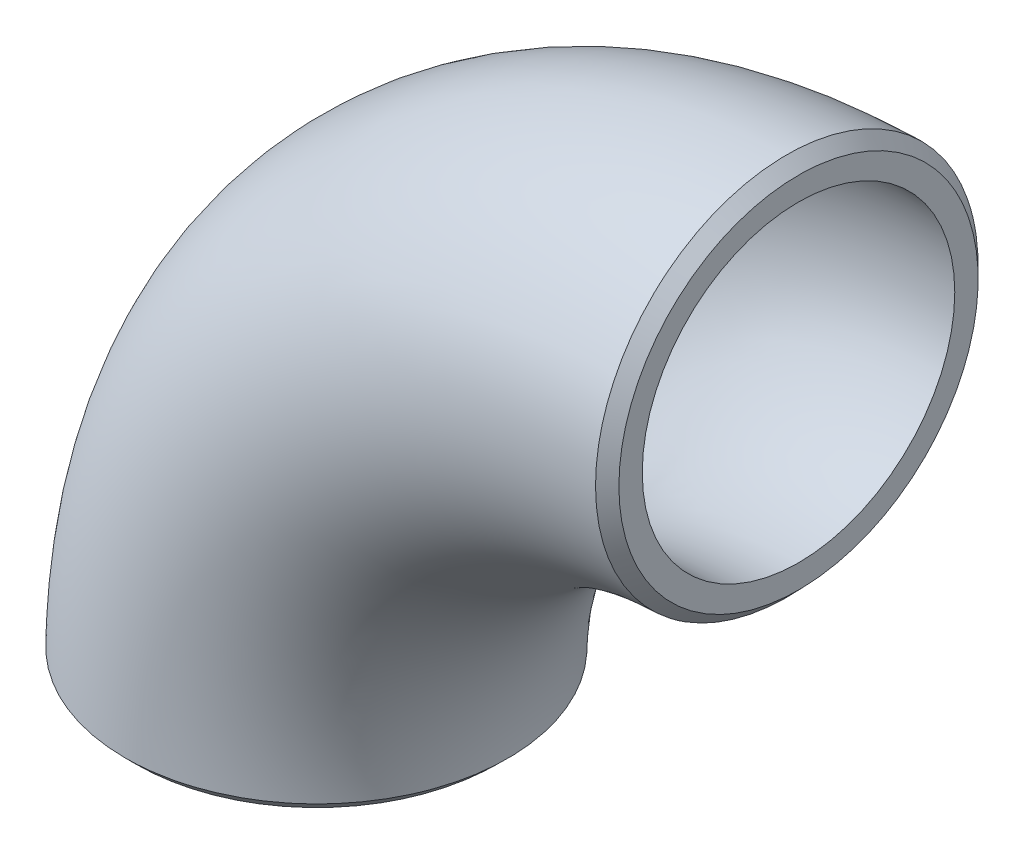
ISO-10303-21;
HEADER;
FILE_DESCRIPTION(('STEP AP214'),'2;1');
FILE_NAME('part.step','',(''),(''),'','','');
FILE_SCHEMA(('AUTOMOTIVE_DESIGN { 1 0 10303 214 1 1 1 1 }'));
ENDSEC;
DATA;
#1=APPLICATION_CONTEXT('core data for automotive mechanical design processes');
#2=APPLICATION_PROTOCOL_DEFINITION('international standard','automotive_design',2000,#1);
#3=PRODUCT_CONTEXT('',#1,'mechanical');
#4=PRODUCT('Part','Part','',(#3));
#5=PRODUCT_RELATED_PRODUCT_CATEGORY('part','',(#4));
#6=PRODUCT_DEFINITION_FORMATION('','',#4);
#7=PRODUCT_DEFINITION_CONTEXT('part definition',#1,'design');
#8=PRODUCT_DEFINITION('design','',#6,#7);
#9=PRODUCT_DEFINITION_SHAPE('','',#8);
#10=(LENGTH_UNIT() NAMED_UNIT(*) SI_UNIT(.MILLI.,.METRE.));
#11=(NAMED_UNIT(*) PLANE_ANGLE_UNIT() SI_UNIT($,.RADIAN.));
#12=(NAMED_UNIT(*) SI_UNIT($,.STERADIAN.) SOLID_ANGLE_UNIT());
#13=UNCERTAINTY_MEASURE_WITH_UNIT(LENGTH_MEASURE(1.E-05),#10,'distance_accuracy_value','');
#14=(GEOMETRIC_REPRESENTATION_CONTEXT(3) GLOBAL_UNCERTAINTY_ASSIGNED_CONTEXT((#13)) GLOBAL_UNIT_ASSIGNED_CONTEXT((#10,
#11,#12)) REPRESENTATION_CONTEXT('',''));
#15=CARTESIAN_POINT('',(0.,0.,0.));
#16=DIRECTION('',(0.,0.,1.));
#17=DIRECTION('',(1.,0.,0.));
#18=AXIS2_PLACEMENT_3D('',#15,#16,#17);
#19=CARTESIAN_POINT('',(0.,0.,0.));
#20=DIRECTION('',(0.,0.,1.));
#21=DIRECTION('',(1.,0.,0.));
#22=AXIS2_PLACEMENT_3D('',#19,#20,#21);
#23=TOROIDAL_SURFACE('',#22,76.2,30.226);
#24=CARTESIAN_POINT('',(-1.84576853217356,76.2014531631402,30.2259906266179));
#25=CARTESIAN_POINT('',(-1.84285933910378,74.2321868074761,30.2284703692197));
#26=CARTESIAN_POINT('',(-1.83967145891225,72.2236360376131,30.0321247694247));
#27=CARTESIAN_POINT('',(-1.83301571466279,68.3530641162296,29.2619378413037));
#28=CARTESIAN_POINT('',(-1.82952295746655,66.4699355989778,28.6939678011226));
#29=CARTESIAN_POINT('',(-1.82214636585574,62.7983053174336,27.1786467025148));
#30=CARTESIAN_POINT('',(-1.8182955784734,61.0310895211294,26.2342601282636));
#31=CARTESIAN_POINT('',(-1.81060855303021,57.7600465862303,24.0510303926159));
#32=CARTESIAN_POINT('',(-1.8067123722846,56.2273932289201,22.8002170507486));
#33=CARTESIAN_POINT('',(-1.79901407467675,53.4004230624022,19.9788931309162));
#34=CARTESIAN_POINT('',(-1.79533135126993,52.1484792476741,18.4510740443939));
#35=CARTESIAN_POINT('',(-1.78854206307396,49.9583101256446,15.18458884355));
#36=CARTESIAN_POINT('',(-1.78539503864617,49.0086837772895,13.4154177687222));
#37=CARTESIAN_POINT('',(-1.78017185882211,47.4887305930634,9.75144188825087));
#38=CARTESIAN_POINT('',(-1.7781015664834,46.9168019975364,7.86971083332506));
#39=CARTESIAN_POINT('',(-1.77524875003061,46.1392532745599,3.99557766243));
#40=CARTESIAN_POINT('',(-1.7744938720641,45.9401774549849,1.98869038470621));
#41=CARTESIAN_POINT('',(-1.77449060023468,45.9393197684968,-1.94737084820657));
#42=CARTESIAN_POINT('',(-1.77520427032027,46.1273858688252,-3.90772846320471));
#43=CARTESIAN_POINT('',(-1.77804533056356,46.9012215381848,-7.81968502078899));
#44=CARTESIAN_POINT('',(-1.78014003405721,47.4798002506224,-9.72315590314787));
#45=CARTESIAN_POINT('',(-1.78530474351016,48.9820775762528,-13.3579151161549));
#46=CARTESIAN_POINT('',(-1.788409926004,49.9171446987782,-15.1156753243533));
#47=CARTESIAN_POINT('',(-1.79527914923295,52.1302193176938,-18.4311189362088));
#48=CARTESIAN_POINT('',(-1.7989531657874,53.380554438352,-19.9519938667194));
#49=CARTESIAN_POINT('',(-1.806535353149,56.1599494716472,-22.7398002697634));
#50=CARTESIAN_POINT('',(-1.81050712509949,57.717857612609,-24.0211618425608));
#51=CARTESIAN_POINT('',(-1.81822811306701,61.0014346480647,-26.2161347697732));
#52=CARTESIAN_POINT('',(-1.82200946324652,62.7344584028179,-27.1460276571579));
#53=CARTESIAN_POINT('',(-1.829386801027,66.3980278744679,-28.6703345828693));
#54=CARTESIAN_POINT('',(-1.83295400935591,68.3181734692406,-29.2537259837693));
#55=CARTESIAN_POINT('',(-1.83958898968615,72.1747050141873,-30.0236336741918));
#56=CARTESIAN_POINT('',(-1.84272527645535,74.1457056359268,-30.2218464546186));
#57=CARTESIAN_POINT('',(-1.85157105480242,80.1209385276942,-30.2342269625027));
#58=CARTESIAN_POINT('',(-1.85658485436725,84.1075208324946,-29.4308875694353));
#59=CARTESIAN_POINT('',(-1.86275762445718,89.5566583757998,-27.1766672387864));
#60=CARTESIAN_POINT('',(-1.86463447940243,91.3201630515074,-26.2371853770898));
#61=CARTESIAN_POINT('',(-1.86799350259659,94.6291542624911,-24.0258500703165));
#62=CARTESIAN_POINT('',(-1.86945306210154,96.1489354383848,-22.7761402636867));
#63=CARTESIAN_POINT('',(-1.87203897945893,98.9386900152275,-19.9923858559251));
#64=CARTESIAN_POINT('',(-1.87317309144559,100.219949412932,-18.4324085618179));
#65=CARTESIAN_POINT('',(-1.87506065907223,102.409571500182,-15.1526473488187));
#66=CARTESIAN_POINT('',(-1.87583432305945,103.339452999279,-13.4190564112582));
#67=CARTESIAN_POINT('',(-1.87708254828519,104.864065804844,-9.74634460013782));
#68=CARTESIAN_POINT('',(-1.87754475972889,105.443644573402,-7.83188274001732));
#69=CARTESIAN_POINT('',(-1.87815354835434,106.210938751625,-3.97442760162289));
#70=CARTESIAN_POINT('',(-1.87830828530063,106.409004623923,-2.00318883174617));
#71=CARTESIAN_POINT('',(-1.878308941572,106.409841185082,1.99013995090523));
#72=CARTESIAN_POINT('',(-1.87815546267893,106.213396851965,3.95344833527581));
#73=CARTESIAN_POINT('',(-1.87754933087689,105.449360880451,7.81174393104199));
#74=CARTESIAN_POINT('',(-1.87708505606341,104.867198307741,9.73652488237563));
#75=CARTESIAN_POINT('',(-1.87584268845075,103.349602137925,13.3968411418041));
#76=CARTESIAN_POINT('',(-1.87507169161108,102.4225642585,15.1312533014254));
#77=CARTESIAN_POINT('',(-1.87318041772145,100.228251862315,18.421914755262));
#78=CARTESIAN_POINT('',(-1.87204890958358,98.9497841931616,19.9793838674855));
#79=CARTESIAN_POINT('',(-1.86946966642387,96.1664763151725,22.7605229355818));
#80=CARTESIAN_POINT('',(-1.86801016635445,94.6459281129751,24.0136261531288));
#81=CARTESIAN_POINT('',(-1.86464410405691,91.3292868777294,26.2320974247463));
#82=CARTESIAN_POINT('',(-1.8627795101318,89.5764348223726,27.1664706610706));
#83=CARTESIAN_POINT('',(-1.85866518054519,85.943514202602,28.6733597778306));
#84=CARTESIAN_POINT('',(-1.85638363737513,84.0361573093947,29.25508785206));
#85=CARTESIAN_POINT('',(-1.85136350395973,80.1295863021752,30.0325557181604));
#86=CARTESIAN_POINT('',(-1.84867772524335,78.1707195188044,30.2235108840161));
#87=CARTESIAN_POINT('',(-1.84576853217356,76.2014531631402,30.2259906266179));
#88=B_SPLINE_CURVE_WITH_KNOTS('',3,(#24,#25,#26,#27,#28,#29,#30,#31,#32,#33,#34,#35,#36,#37,#38,
#39,#40,#41,#42,#43,#44,#45,#46,#47,#48,#49,#50,#51,#52,#53,#54,#55,#56,#57,#58,#59,#60,#61,#62,
#63,#64,#65,#66,#67,#68,#69,#70,#71,#72,#73,#74,#75,#76,#77,#78,#79,#80,#81,#82,#83,#84,#85,#86,
#87),.UNSPECIFIED.,.T.,.F.,(4,2,2,2,2,2,2,2,2,2,2,2,2,2,2,2,2,2,2,2,2,2,2,2,2,2,2,2,2,2,2,4),
(-0.174454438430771,-0.168908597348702,-0.163362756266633,-0.157816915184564,-0.152271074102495,
-0.146725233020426,-0.141179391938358,-0.135633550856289,-0.13008770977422,-0.124541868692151,
-0.118996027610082,-0.113450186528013,-0.107904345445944,-0.102358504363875,-0.096812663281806,
-0.0912668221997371,-0.0857209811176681,-0.0746292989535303,-0.0690834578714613,
-0.0635376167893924,-0.0579917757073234,-0.0524459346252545,-0.0469000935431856,
-0.0413542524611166,-0.0358084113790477,-0.0302625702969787,-0.0247167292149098,
-0.0191708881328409,-0.0136250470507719,-0.00807920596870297,-0.00253336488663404,
0.0030124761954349),.UNSPECIFIED.);
#89=CARTESIAN_POINT('',(-1.84576853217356,76.2014531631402,30.2259906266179));
#90=VERTEX_POINT('',#89);
#91=EDGE_CURVE('E44',#90,#90,#88,.F.);
#92=ORIENTED_EDGE('',*,*,#91,.T.);
#93=EDGE_LOOP('',(#92));
#94=FACE_BOUND('',#93,.T.);
#95=CARTESIAN_POINT('',(-76.2014531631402,1.84576853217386,30.225990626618));
#96=CARTESIAN_POINT('',(-76.7119858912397,1.84652317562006,30.2257505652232));
#97=CARTESIAN_POINT('',(-77.2224815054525,1.84726323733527,30.2123069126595));
#98=CARTESIAN_POINT('',(-78.2447368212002,1.8487182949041,30.1594057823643));
#99=CARTESIAN_POINT('',(-78.756489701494,1.84943314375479,30.1198160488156));
#100=CARTESIAN_POINT('',(-79.7773714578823,1.85083419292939,30.0150282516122));
#101=CARTESIAN_POINT('',(-80.2865003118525,1.85152039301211,29.9498299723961));
#102=CARTESIAN_POINT('',(-81.2982038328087,1.85286001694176,29.7937310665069));
#103=CARTESIAN_POINT('',(-81.8007985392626,1.85351358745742,29.7029605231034));
#104=CARTESIAN_POINT('',(-82.7983877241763,1.85478901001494,29.496578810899));
#105=CARTESIAN_POINT('',(-83.2934068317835,1.85541099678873,29.381086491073));
#106=CARTESIAN_POINT('',(-84.2767915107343,1.8566266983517,29.1255109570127));
#107=CARTESIAN_POINT('',(-84.7651603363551,1.85722042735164,28.9854402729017));
#108=CARTESIAN_POINT('',(-85.7353757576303,1.85838130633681,28.680351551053));
#109=CARTESIAN_POINT('',(-86.2172031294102,1.85894838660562,28.5152723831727));
#110=CARTESIAN_POINT('',(-87.174480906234,1.86005790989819,28.1601797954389));
#111=CARTESIAN_POINT('',(-87.6498841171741,1.86060020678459,27.9700391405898));
#112=CARTESIAN_POINT('',(-88.5914044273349,1.86165831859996,27.56527029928));
#113=CARTESIAN_POINT('',(-89.0574985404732,1.86217407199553,27.3505886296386));
#114=CARTESIAN_POINT('',(-89.9776017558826,1.86317773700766,26.8981292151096));
#115=CARTESIAN_POINT('',(-90.4316253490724,1.86366568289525,26.6603809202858));
#116=CARTESIAN_POINT('',(-91.3255964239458,1.86461338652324,26.1630864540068));
#117=CARTESIAN_POINT('',(-91.7655858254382,1.86507323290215,25.9036156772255));
#118=CARTESIAN_POINT('',(-92.6296060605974,1.86596444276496,25.3638210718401));
#119=CARTESIAN_POINT('',(-93.0537041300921,1.86639593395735,25.0836048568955));
#120=CARTESIAN_POINT('',(-93.8874190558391,1.86723381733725,24.5022017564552));
#121=CARTESIAN_POINT('',(-94.2970324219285,1.86764020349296,24.2010098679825));
#122=CARTESIAN_POINT('',(-95.1018128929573,1.86842927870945,23.5774120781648));
#123=CARTESIAN_POINT('',(-95.4969314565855,1.86881189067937,23.254943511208));
#124=CARTESIAN_POINT('',(-96.2720979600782,1.86955412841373,22.5888621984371));
#125=CARTESIAN_POINT('',(-96.6520680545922,1.86991364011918,22.2451588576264));
#126=CARTESIAN_POINT('',(-97.3956410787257,1.87060978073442,21.5373905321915));
#127=CARTESIAN_POINT('',(-97.7591673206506,1.87094630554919,21.1732449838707));
#128=CARTESIAN_POINT('',(-98.465309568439,1.87159360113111,20.4288837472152));
#129=CARTESIAN_POINT('',(-98.8080264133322,1.87190449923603,20.0487637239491));
#130=CARTESIAN_POINT('',(-99.4720045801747,1.87250119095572,19.2734641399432));
#131=CARTESIAN_POINT('',(-99.7933632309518,1.87278710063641,18.8783679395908));
#132=CARTESIAN_POINT('',(-100.414898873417,1.87333529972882,18.0735239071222));
#133=CARTESIAN_POINT('',(-100.715129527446,1.87359764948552,17.6638174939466));
#134=CARTESIAN_POINT('',(-101.295048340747,1.87410054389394,16.8295117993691));
#135=CARTESIAN_POINT('',(-101.574716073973,1.8743410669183,16.4048983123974));
#136=CARTESIAN_POINT('',(-102.113565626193,1.87480114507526,15.5393426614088));
#137=CARTESIAN_POINT('',(-102.372615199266,1.87502056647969,15.0983181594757));
#138=CARTESIAN_POINT('',(-102.868992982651,1.87543823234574,14.202420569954));
#139=CARTESIAN_POINT('',(-103.106250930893,1.8756364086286,13.7475085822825));
#140=CARTESIAN_POINT('',(-103.557324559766,1.87601092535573,12.8263818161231));
#141=CARTESIAN_POINT('',(-103.771147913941,1.87618727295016,12.360170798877));
#142=CARTESIAN_POINT('',(-104.173777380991,1.87651766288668,11.4191699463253));
#143=CARTESIAN_POINT('',(-104.362675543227,1.87667178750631,10.9444194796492));
#144=CARTESIAN_POINT('',(-104.715629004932,1.8769585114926,9.98803795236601));
#145=CARTESIAN_POINT('',(-104.879785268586,1.87709119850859,9.50644414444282));
#146=CARTESIAN_POINT('',(-105.183244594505,1.87733549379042,8.53616539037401));
#147=CARTESIAN_POINT('',(-105.322579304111,1.87744712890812,8.04749034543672));
#148=CARTESIAN_POINT('',(-105.576771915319,1.87765011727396,7.06292447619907));
#149=CARTESIAN_POINT('',(-105.691587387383,1.87774143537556,6.56702270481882));
#150=CARTESIAN_POINT('',(-105.89652646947,1.87790412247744,5.56763011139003));
#151=CARTESIAN_POINT('',(-105.986527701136,1.87797539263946,5.06411415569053));
#152=CARTESIAN_POINT('',(-106.140915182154,1.87809744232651,4.05127968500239));
#153=CARTESIAN_POINT('',(-106.205205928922,1.87814814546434,3.54194663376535));
#154=CARTESIAN_POINT('',(-106.308099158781,1.87822916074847,2.5211443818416));
#155=CARTESIAN_POINT('',(-106.346724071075,1.87825949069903,2.00967744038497));
#156=CARTESIAN_POINT('',(-106.397600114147,1.87829938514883,0.988227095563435));
#157=CARTESIAN_POINT('',(-106.409994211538,1.87830906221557,0.478250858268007));
#158=CARTESIAN_POINT('',(-106.408822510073,1.87830814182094,-0.539259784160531));
#159=CARTESIAN_POINT('',(-106.39537878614,1.87829763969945,-1.04679436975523));
#160=CARTESIAN_POINT('',(-106.34318245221,1.87825670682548,-2.06101556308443));
#161=CARTESIAN_POINT('',(-106.304407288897,1.87822625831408,-2.56770101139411));
#162=CARTESIAN_POINT('',(-106.201022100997,1.87814484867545,-3.5803074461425));
#163=CARTESIAN_POINT('',(-106.136318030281,1.87809381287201,-4.08621884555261));
#164=CARTESIAN_POINT('',(-105.98090720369,1.87797094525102,-5.09733314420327));
#165=CARTESIAN_POINT('',(-105.890037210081,1.87789898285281,-5.60251093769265));
#166=CARTESIAN_POINT('',(-105.682650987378,1.87773433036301,-6.60785984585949));
#167=CARTESIAN_POINT('',(-105.566120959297,1.87764162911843,-7.10802811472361));
#168=CARTESIAN_POINT('',(-105.30821050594,1.87743561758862,-8.09984952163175));
#169=CARTESIAN_POINT('',(-105.166927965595,1.87732238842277,-8.59152811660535));
#170=CARTESIAN_POINT('',(-104.860174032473,1.87707537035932,-9.56535589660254));
#171=CARTESIAN_POINT('',(-104.694790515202,1.87694165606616,-10.0475327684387));
#172=CARTESIAN_POINT('',(-104.340444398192,1.87665367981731,-11.0014589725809));
#173=CARTESIAN_POINT('',(-104.151555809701,1.87649948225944,-11.4732357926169));
#174=CARTESIAN_POINT('',(-103.749727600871,1.87616961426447,-12.4076040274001));
#175=CARTESIAN_POINT('',(-103.536738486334,1.87599389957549,-12.8701741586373));
#176=CARTESIAN_POINT('',(-103.086868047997,1.87562026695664,-13.7856751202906));
#177=CARTESIAN_POINT('',(-102.849901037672,1.87542226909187,-14.238563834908));
#178=CARTESIAN_POINT('',(-102.352582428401,1.87500364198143,-15.1332007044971));
#179=CARTESIAN_POINT('',(-102.092158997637,1.87478294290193,-15.5749089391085));
#180=CARTESIAN_POINT('',(-101.548579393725,1.87431863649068,-16.4453064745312));
#181=CARTESIAN_POINT('',(-101.265379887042,1.87407498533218,-16.873968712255));
#182=CARTESIAN_POINT('',(-100.679126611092,1.87356627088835,-17.714135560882));
#183=CARTESIAN_POINT('',(-100.376185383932,1.87330132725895,-18.1257187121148));
#184=CARTESIAN_POINT('',(-99.7512092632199,1.87274958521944,-18.931057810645));
#185=CARTESIAN_POINT('',(-99.4292699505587,1.87246289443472,-19.3248879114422));
#186=CARTESIAN_POINT('',(-98.7664801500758,1.87186676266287,-20.095083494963));
#187=CARTESIAN_POINT('',(-98.4256638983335,1.87155736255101,-20.4714784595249));
#188=CARTESIAN_POINT('',(-97.7250850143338,1.87091478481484,-21.207576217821));
#189=CARTESIAN_POINT('',(-97.3652876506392,1.87058156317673,-21.567245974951));
#190=CARTESIAN_POINT('',(-96.625208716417,1.8698883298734,-22.2699427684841));
#191=CARTESIAN_POINT('',(-96.2448065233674,1.86952815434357,-22.6128427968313));
#192=CARTESIAN_POINT('',(-95.4661668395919,1.86878214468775,-23.2800299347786));
#193=CARTESIAN_POINT('',(-95.0678820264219,1.86839624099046,-23.6042617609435));
#194=CARTESIAN_POINT('',(-94.2562989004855,1.86759999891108,-24.2315286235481));
#195=CARTESIAN_POINT('',(-93.8430344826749,1.86718971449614,-24.5346074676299));
#196=CARTESIAN_POINT('',(-93.0038353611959,1.86634543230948,-25.1172818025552));
#197=CARTESIAN_POINT('',(-92.5779883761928,1.86591158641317,-25.3970036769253));
#198=CARTESIAN_POINT('',(-91.7140431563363,1.86501946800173,-25.9341439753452));
#199=CARTESIAN_POINT('',(-91.2759808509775,1.86456126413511,-26.1916202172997));
#200=CARTESIAN_POINT('',(-90.3871459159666,1.86361815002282,-26.6842092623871));
#201=CARTESIAN_POINT('',(-89.9363666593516,1.86313322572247,-26.9193101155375));
#202=CARTESIAN_POINT('',(-89.0219110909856,1.86213482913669,-27.3672574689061));
#203=CARTESIAN_POINT('',(-88.5581948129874,1.86162126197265,-27.5800223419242));
#204=CARTESIAN_POINT('',(-87.618360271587,1.86056436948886,-27.9828675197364));
#205=CARTESIAN_POINT('',(-87.1421930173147,1.86002091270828,-28.1728335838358));
#206=CARTESIAN_POINT('',(-86.1803751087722,1.85890529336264,-28.5282793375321));
#207=CARTESIAN_POINT('',(-85.6947171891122,1.85833310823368,-28.6937393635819));
#208=CARTESIAN_POINT('',(-84.7166275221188,1.8571616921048,-28.9996489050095));
#209=CARTESIAN_POINT('',(-84.2242107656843,1.85656251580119,-29.140146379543));
#210=CARTESIAN_POINT('',(-83.2351537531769,1.85533839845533,-29.395374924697));
#211=CARTESIAN_POINT('',(-82.7385433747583,1.85471358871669,-29.510221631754));
#212=CARTESIAN_POINT('',(-81.7417834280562,1.85343715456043,-29.7140186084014));
#213=CARTESIAN_POINT('',(-81.2416514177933,1.85278562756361,-29.8030548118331));
#214=CARTESIAN_POINT('',(-80.2363916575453,1.85145259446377,-29.9561339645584));
#215=CARTESIAN_POINT('',(-79.7312550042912,1.85077102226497,-30.0201184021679));
#216=CARTESIAN_POINT('',(-78.7167031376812,1.84937697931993,-30.1227319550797));
#217=CARTESIAN_POINT('',(-78.2072792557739,1.84866441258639,-30.1612752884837));
#218=CARTESIAN_POINT('',(-77.1849313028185,1.84720818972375,-30.213002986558));
#219=CARTESIAN_POINT('',(-76.6720016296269,1.84646441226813,-30.226076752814));
#220=CARTESIAN_POINT('',(-75.6449329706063,1.84494553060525,-30.2259116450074));
#221=CARTESIAN_POINT('',(-75.1307939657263,1.84417035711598,-30.2126110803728));
#222=CARTESIAN_POINT('',(-74.1041371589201,1.84259059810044,-30.1593174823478));
#223=CARTESIAN_POINT('',(-73.5916187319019,1.84178602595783,-30.1193364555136));
#224=CARTESIAN_POINT('',(-72.5696950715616,1.84014983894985,-30.0133534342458));
#225=CARTESIAN_POINT('',(-72.0602877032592,1.83931824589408,-29.9473719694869));
#226=CARTESIAN_POINT('',(-71.0460846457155,1.83762977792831,-29.7898098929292));
#227=CARTESIAN_POINT('',(-70.5412840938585,1.83677293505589,-29.6982605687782));
#228=CARTESIAN_POINT('',(-69.5377923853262,1.83503589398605,-29.4900503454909));
#229=CARTESIAN_POINT('',(-69.0390922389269,1.83415573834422,-29.3734327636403));
#230=CARTESIAN_POINT('',(-68.0493036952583,1.83237393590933,-29.1155477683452));
#231=CARTESIAN_POINT('',(-67.5582006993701,1.83147234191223,-28.9743363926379));
#232=CARTESIAN_POINT('',(-66.5851000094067,1.82964960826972,-28.6677550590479));
#233=CARTESIAN_POINT('',(-66.1030806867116,1.82872853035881,-28.502453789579));
#234=CARTESIAN_POINT('',(-65.149530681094,1.82686822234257,-28.1480323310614));
#235=CARTESIAN_POINT('',(-64.6779727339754,1.82592905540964,-27.958985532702));
#236=CARTESIAN_POINT('',(-63.7436668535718,1.8240290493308,-27.5565124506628));
#237=CARTESIAN_POINT('',(-63.280950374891,1.82306815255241,-27.3430131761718));
#238=CARTESIAN_POINT('',(-62.3649161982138,1.82112731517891,-26.892060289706));
#239=CARTESIAN_POINT('',(-61.9116464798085,1.82014731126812,-26.6545092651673));
#240=CARTESIAN_POINT('',(-61.0165630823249,1.8181732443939,-26.1562318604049));
#241=CARTESIAN_POINT('',(-60.5747803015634,1.81717915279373,-25.89544994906));
#242=CARTESIAN_POINT('',(-59.7050325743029,1.81518236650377,-25.3515403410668));
#243=CARTESIAN_POINT('',(-59.2770712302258,1.81417966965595,-25.0684068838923));
#244=CARTESIAN_POINT('',(-58.438248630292,1.81217523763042,-24.4823629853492));
#245=CARTESIAN_POINT('',(-58.0273095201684,1.81117352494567,-24.1795639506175));
#246=CARTESIAN_POINT('',(-57.2229315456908,1.80917502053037,-23.5547340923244));
#247=CARTESIAN_POINT('',(-56.8294296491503,1.80817822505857,-23.2327844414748));
#248=CARTESIAN_POINT('',(-56.0595798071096,1.80619167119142,-22.5697471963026));
#249=CARTESIAN_POINT('',(-55.6832153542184,1.80520190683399,-22.2286787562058));
#250=CARTESIAN_POINT('',(-54.9469437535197,1.8032305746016,-21.5273433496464));
#251=CARTESIAN_POINT('',(-54.5870818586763,1.80224903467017,-21.1670288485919));
#252=CARTESIAN_POINT('',(-53.8841463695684,1.80029721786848,-20.4260100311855));
#253=CARTESIAN_POINT('',(-53.5411940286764,1.79932705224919,-20.045190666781));
#254=CARTESIAN_POINT('',(-52.8741280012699,1.79740860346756,-19.2659489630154));
#255=CARTESIAN_POINT('',(-52.5500577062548,1.79646037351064,-18.8674895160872));
#256=CARTESIAN_POINT('',(-51.9233585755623,1.79459737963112,-18.0558738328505));
#257=CARTESIAN_POINT('',(-51.6206704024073,1.79368252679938,-17.642763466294));
#258=CARTESIAN_POINT('',(-51.0389346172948,1.79189663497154,-16.804114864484));
#259=CARTESIAN_POINT('',(-50.7597488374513,1.79102535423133,-16.3786724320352));
#260=CARTESIAN_POINT('',(-50.2233941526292,1.78932830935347,-15.5152579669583));
#261=CARTESIAN_POINT('',(-49.9661843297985,1.78850246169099,-15.0773113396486));
#262=CARTESIAN_POINT('',(-49.4738932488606,1.78690120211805,-14.188321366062));
#263=CARTESIAN_POINT('',(-49.2388442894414,1.7861258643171,-13.7372601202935));
#264=CARTESIAN_POINT('',(-48.7908600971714,1.7846303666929,-12.8218037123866));
#265=CARTESIAN_POINT('',(-48.5780278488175,1.78391046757,-12.3573581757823));
#266=CARTESIAN_POINT('',(-48.1751392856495,1.78253303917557,-11.4160587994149));
#267=CARTESIAN_POINT('',(-47.9851967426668,1.78187582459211,-10.9391562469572));
#268=CARTESIAN_POINT('',(-47.6301402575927,1.78063593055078,-9.9767273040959));
#269=CARTESIAN_POINT('',(-47.4650022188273,1.78005317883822,-9.49120980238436));
#270=CARTESIAN_POINT('',(-47.1599121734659,1.77896752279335,-8.51374627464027));
#271=CARTESIAN_POINT('',(-47.0198942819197,1.77846441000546,-8.02182080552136));
#272=CARTESIAN_POINT('',(-46.7655445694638,1.77754402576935,-7.03354856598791));
#273=CARTESIAN_POINT('',(-46.651108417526,1.77712640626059,-6.53722866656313));
#274=CARTESIAN_POINT('',(-46.4478568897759,1.77638133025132,-5.54063769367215));
#275=CARTESIAN_POINT('',(-46.3589795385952,1.77605365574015,-5.04037925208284));
#276=CARTESIAN_POINT('',(-46.2062127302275,1.77548849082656,-4.03469772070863));
#277=CARTESIAN_POINT('',(-46.1423905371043,1.77525124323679,-3.52926441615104));
#278=CARTESIAN_POINT('',(-46.0402105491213,1.77487011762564,-2.51389544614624));
#279=CARTESIAN_POINT('',(-46.0019499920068,1.77472659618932,-2.00394998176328));
#280=CARTESIAN_POINT('',(-45.9512749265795,1.77453599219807,-0.980271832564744));
#281=CARTESIAN_POINT('',(-45.9389880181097,1.77448938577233,-0.46653283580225));
#282=CARTESIAN_POINT('',(-45.9405678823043,1.774495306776,0.560319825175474));
#283=CARTESIAN_POINT('',(-45.9544049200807,1.77454772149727,1.07343353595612));
#284=CARTESIAN_POINT('',(-46.0080762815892,1.77474949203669,2.09511132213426));
#285=CARTESIAN_POINT('',(-46.0477488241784,1.77489824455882,2.6036838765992));
#286=CARTESIAN_POINT('',(-46.1527287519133,1.77528965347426,3.61629297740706));
#287=CARTESIAN_POINT('',(-46.2179420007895,1.77553196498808,4.1203393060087));
#288=CARTESIAN_POINT('',(-46.3733158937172,1.77610654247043,5.1240117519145));
#289=CARTESIAN_POINT('',(-46.4634493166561,1.77643871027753,5.62364208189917));
#290=CARTESIAN_POINT('',(-46.6695439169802,1.7771937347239,6.62014871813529));
#291=CARTESIAN_POINT('',(-46.7856314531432,1.77761703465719,7.11699892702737));
#292=CARTESIAN_POINT('',(-47.0434721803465,1.77854920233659,8.10660956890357));
#293=CARTESIAN_POINT('',(-47.1853494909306,1.77905848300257,8.59933761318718));
#294=CARTESIAN_POINT('',(-47.4938419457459,1.7801551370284,9.57751859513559));
#295=CARTESIAN_POINT('',(-47.6604809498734,1.78074258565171,10.0629640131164));
#296=CARTESIAN_POINT('',(-48.0179965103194,1.7819895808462,11.023229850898));
#297=CARTESIAN_POINT('',(-48.2088006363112,1.78264891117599,11.4980772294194));
#298=CARTESIAN_POINT('',(-48.6132232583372,1.78402980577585,12.4353028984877));
#299=CARTESIAN_POINT('',(-48.8267303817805,1.78475106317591,12.8977292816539));
#300=CARTESIAN_POINT('',(-49.276315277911,1.78624996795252,13.8101931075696));
#301=CARTESIAN_POINT('',(-49.5123413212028,1.78702748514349,14.2602560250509));
#302=CARTESIAN_POINT('',(-50.0070666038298,1.7886343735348,15.1481861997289));
#303=CARTESIAN_POINT('',(-50.2657829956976,1.78946378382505,15.5860438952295));
#304=CARTESIAN_POINT('',(-50.8057628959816,1.79116950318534,16.449927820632));
#305=CARTESIAN_POINT('',(-51.0871076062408,1.79204597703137,16.8759033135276));
#306=CARTESIAN_POINT('',(-51.6726409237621,1.79384029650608,17.7147530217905));
#307=CARTESIAN_POINT('',(-51.9769279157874,1.79475831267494,18.1275585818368));
#308=CARTESIAN_POINT('',(-52.6062201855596,1.79662547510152,18.9376241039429));
#309=CARTESIAN_POINT('',(-52.9312432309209,1.79757464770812,19.3348702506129));
#310=CARTESIAN_POINT('',(-53.5997915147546,1.79949352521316,20.1111740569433));
#311=CARTESIAN_POINT('',(-53.9432510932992,1.8004631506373,20.4902882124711));
#312=CARTESIAN_POINT('',(-54.6470200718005,1.80241332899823,21.2279179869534));
#313=CARTESIAN_POINT('',(-55.0072077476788,1.80339377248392,21.5865497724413));
#314=CARTESIAN_POINT('',(-55.7446168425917,1.80536420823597,22.2851122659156));
#315=CARTESIAN_POINT('',(-56.1218215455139,1.80635419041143,22.6250606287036));
#316=CARTESIAN_POINT('',(-56.8938825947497,1.80834242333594,23.2863440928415));
#317=CARTESIAN_POINT('',(-57.2887813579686,1.80934068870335,23.6076297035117));
#318=CARTESIAN_POINT('',(-58.0964510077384,1.81134308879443,24.2313969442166));
#319=CARTESIAN_POINT('',(-58.5093043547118,1.81234722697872,24.5337717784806));
#320=CARTESIAN_POINT('',(-59.351900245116,1.81435600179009,25.1187163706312));
#321=CARTESIAN_POINT('',(-59.7817174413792,1.81536061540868,25.4011785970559));
#322=CARTESIAN_POINT('',(-60.6535377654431,1.81735731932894,25.9427554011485));
#323=CARTESIAN_POINT('',(-61.0954879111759,1.8183494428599,26.2019552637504));
#324=CARTESIAN_POINT('',(-61.990193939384,1.82031787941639,26.6965781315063));
#325=CARTESIAN_POINT('',(-62.4428996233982,1.82129423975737,26.9320919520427));
#326=CARTESIAN_POINT('',(-63.3581394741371,1.82322874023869,27.3792421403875));
#327=CARTESIAN_POINT('',(-63.8206371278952,1.82418692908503,27.5909532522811));
#328=CARTESIAN_POINT('',(-64.7554651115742,1.82608444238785,27.9907034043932));
#329=CARTESIAN_POINT('',(-65.2277901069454,1.82702377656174,28.1787549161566));
#330=CARTESIAN_POINT('',(-66.1833360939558,1.82888590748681,28.5314366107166));
#331=CARTESIAN_POINT('',(-66.666594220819,1.82980861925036,28.6959661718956));
#332=CARTESIAN_POINT('',(-67.6424039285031,1.83163487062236,29.0009776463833));
#333=CARTESIAN_POINT('',(-68.1349810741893,1.8325383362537,29.1413777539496));
#334=CARTESIAN_POINT('',(-69.1277747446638,1.83432303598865,29.3972811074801));
#335=CARTESIAN_POINT('',(-69.6280062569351,1.83520421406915,29.5127262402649));
#336=CARTESIAN_POINT('',(-70.6327427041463,1.83693872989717,29.717767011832));
#337=CARTESIAN_POINT('',(-71.1372376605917,1.83779211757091,29.8074115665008));
#338=CARTESIAN_POINT('',(-72.147213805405,1.83946736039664,29.9605657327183));
#339=CARTESIAN_POINT('',(-72.6526726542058,1.84028936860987,30.0242226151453));
#340=CARTESIAN_POINT('',(-73.6647142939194,1.84190364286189,30.1256539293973));
#341=CARTESIAN_POINT('',(-74.1712897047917,1.8426959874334,30.1635020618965));
#342=CARTESIAN_POINT('',(-75.185734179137,1.84425307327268,30.2137752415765));
#343=CARTESIAN_POINT('',(-75.693603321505,1.84501781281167,30.2261986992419));
#344=CARTESIAN_POINT('',(-76.2014531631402,1.84576853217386,30.225990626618));
#345=B_SPLINE_CURVE_WITH_KNOTS('',3,(#95,#96,#97,#98,#99,#100,#101,#102,#103,#104,#105,#106,
#107,#108,#109,#110,#111,#112,#113,#114,#115,#116,#117,#118,#119,#120,#121,#122,#123,#124,#125,
#126,#127,#128,#129,#130,#131,#132,#133,#134,#135,#136,#137,#138,#139,#140,#141,#142,#143,#144,
#145,#146,#147,#148,#149,#150,#151,#152,#153,#154,#155,#156,#157,#158,#159,#160,#161,#162,#163,
#164,#165,#166,#167,#168,#169,#170,#171,#172,#173,#174,#175,#176,#177,#178,#179,#180,#181,#182,
#183,#184,#185,#186,#187,#188,#189,#190,#191,#192,#193,#194,#195,#196,#197,#198,#199,#200,#201,
#202,#203,#204,#205,#206,#207,#208,#209,#210,#211,#212,#213,#214,#215,#216,#217,#218,#219,#220,
#221,#222,#223,#224,#225,#226,#227,#228,#229,#230,#231,#232,#233,#234,#235,#236,#237,#238,#239,
#240,#241,#242,#243,#244,#245,#246,#247,#248,#249,#250,#251,#252,#253,#254,#255,#256,#257,#258,
#259,#260,#261,#262,#263,#264,#265,#266,#267,#268,#269,#270,#271,#272,#273,#274,#275,#276,#277,
#278,#279,#280,#281,#282,#283,#284,#285,#286,#287,#288,#289,#290,#291,#292,#293,#294,#295,#296,
#297,#298,#299,#300,#301,#302,#303,#304,#305,#306,#307,#308,#309,#310,#311,#312,#313,#314,#315,
#316,#317,#318,#319,#320,#321,#322,#323,#324,#325,#326,#327,#328,#329,#330,#331,#332,#333,#334,
#335,#336,#337,#338,#339,#340,#341,#342,#343,#344),.UNSPECIFIED.,.F.,.F.,(4,2,2,2,2,2,2,2,2,2,2,
2,2,2,2,2,2,2,2,2,2,2,2,2,2,2,2,2,2,2,2,2,2,2,2,2,2,2,2,2,2,2,2,2,2,2,2,2,2,2,2,2,2,2,2,2,2,2,2,
2,2,2,2,2,2,2,2,2,2,2,2,2,2,2,2,2,2,2,2,2,2,2,2,2,2,2,2,2,2,2,2,2,2,2,2,2,2,2,2,2,2,2,2,2,2,2,2,
2,2,2,2,2,2,2,2,2,2,2,2,2,2,2,2,2,4),(0.,1.53138243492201,3.07057107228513,4.6097726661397,
6.14128166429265,7.66558703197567,9.18911755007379,10.7164341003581,12.2518270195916,
13.7906322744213,15.3274981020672,16.8592349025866,18.3835183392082,19.9081665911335,
21.4375252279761,22.9739319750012,24.5168891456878,26.0516481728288,27.5788507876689,
29.1020229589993,30.62668827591,32.1604543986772,33.6990038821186,35.2370480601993,
36.7692429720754,38.2950055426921,39.8188086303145,41.3452276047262,42.8790451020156,
44.4185082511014,45.9566242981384,47.4863352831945,49.0088366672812,50.5326954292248,
52.0621321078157,53.6013250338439,55.1413477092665,56.6754123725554,58.2040174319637,
59.7279256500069,61.2550222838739,62.787782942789,64.3254083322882,65.8660317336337,
67.3985330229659,68.9238910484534,70.4465678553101,71.972134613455,73.5078768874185,
75.0479550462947,76.5847427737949,78.1125882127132,79.6363350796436,81.1608912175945,
82.6908379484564,84.2281564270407,85.7667018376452,87.3022585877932,88.8307465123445,
90.3540854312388,91.8809613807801,93.4129596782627,94.9515957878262,96.4938350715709,
98.0353807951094,99.5757117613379,101.114166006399,102.649982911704,104.182345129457,
105.710420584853,107.233884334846,108.762020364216,110.296613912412,111.834979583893,
113.373743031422,114.904443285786,116.429063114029,117.952181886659,119.479254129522,
121.016033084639,122.556214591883,124.091938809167,125.617891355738,127.140937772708,
128.66617073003,130.198186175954,131.737527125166,133.275362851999,134.80910423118,
136.336471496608,137.860103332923,139.387798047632,140.921271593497,142.462261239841,
144.001497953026,145.531187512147,147.0552913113,148.577736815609,150.107762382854,
151.645356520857,153.184441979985,154.719018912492,156.246387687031,157.770328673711,
159.295431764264,160.826275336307,162.364104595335,163.903269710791,165.437276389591,
166.961478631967,168.484214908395,170.010820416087,171.545386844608,173.087689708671,
174.624085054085,176.154345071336,177.679657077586,179.204161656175,180.735004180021,
182.270938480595,183.810411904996,185.346947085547,186.87464970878,188.397971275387,
189.921388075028),.UNSPECIFIED.);
#346=CARTESIAN_POINT('',(-76.2014531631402,1.84576853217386,30.225990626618));
#347=VERTEX_POINT('',#346);
#348=EDGE_CURVE('E49',#347,#347,#345,.F.);
#349=ORIENTED_EDGE('',*,*,#348,.T.);
#350=EDGE_LOOP('',(#349));
#351=FACE_BOUND('',#350,.T.);
#352=ADVANCED_FACE('F32',(#94,#351),#23,.T.);
#353=CARTESIAN_POINT('',(2.49131079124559E-13,76.2,0.));
#354=DIRECTION('',(1.,0.,0.));
#355=DIRECTION('',(0.,0.,1.));
#356=AXIS2_PLACEMENT_3D('',#353,#354,#355);
#357=PLANE('',#356);
#358=CARTESIAN_POINT('',(2.86251381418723E-13,76.2,28.3802578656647));
#359=CARTESIAN_POINT('',(2.87785550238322E-13,76.6767611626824,28.3797016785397));
#360=CARTESIAN_POINT('',(2.89337060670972E-13,77.1535217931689,28.3672910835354));
#361=CARTESIAN_POINT('',(2.92458168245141E-13,78.1058973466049,28.3186025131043));
#362=CARTESIAN_POINT('',(2.94027768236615E-13,78.5815120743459,28.2823207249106));
#363=CARTESIAN_POINT('',(2.97172780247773E-13,79.5317552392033,28.1855829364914));
#364=CARTESIAN_POINT('',(2.98748195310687E-13,80.0063761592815,28.1250530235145));
#365=CARTESIAN_POINT('',(3.01882647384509E-13,80.9547703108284,27.9796937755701));
#366=CARTESIAN_POINT('',(3.03441531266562E-13,81.4285217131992,27.8947220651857));
#367=CARTESIAN_POINT('',(3.06550979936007E-13,82.3718562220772,27.700623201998));
#368=CARTESIAN_POINT('',(3.08101527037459E-13,82.8414312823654,27.5914569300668));
#369=CARTESIAN_POINT('',(3.11191005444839E-13,83.7731776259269,27.3496773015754));
#370=CARTESIAN_POINT('',(3.12729956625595E-13,84.2353652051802,27.217126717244));
#371=CARTESIAN_POINT('',(3.15781413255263E-13,85.1508970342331,26.9293038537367));
#372=CARTESIAN_POINT('',(3.17293990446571E-13,85.6042658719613,26.7741097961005));
#373=CARTESIAN_POINT('',(3.20278348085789E-13,86.500779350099,26.4415561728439));
#374=CARTESIAN_POINT('',(3.21750265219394E-13,86.9439571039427,26.264285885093));
#375=CARTESIAN_POINT('',(3.2466628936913E-13,87.8211840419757,25.8874717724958));
#376=CARTESIAN_POINT('',(3.26110371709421E-13,88.2552251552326,25.6879091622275));
#377=CARTESIAN_POINT('',(3.28962638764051E-13,89.1141435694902,25.2664767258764));
#378=CARTESIAN_POINT('',(3.30370687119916E-13,89.5389853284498,25.0445344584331));
#379=CARTESIAN_POINT('',(3.33139149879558E-13,90.378512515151,24.5785354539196));
#380=CARTESIAN_POINT('',(3.34499359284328E-13,90.7931523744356,24.3343966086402));
#381=CARTESIAN_POINT('',(3.37149410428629E-13,91.6108910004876,23.8244417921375));
#382=CARTESIAN_POINT('',(3.38438990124E-13,92.0139444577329,23.5585531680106));
#383=CARTESIAN_POINT('',(3.40971331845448E-13,92.8039829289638,23.0080325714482));
#384=CARTESIAN_POINT('',(3.42214299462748E-13,93.1910395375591,22.7235033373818));
#385=CARTESIAN_POINT('',(3.44657574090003E-13,93.948211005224,22.1365999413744));
#386=CARTESIAN_POINT('',(3.45858067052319E-13,94.3184025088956,21.8343246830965));
#387=CARTESIAN_POINT('',(3.48220788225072E-13,95.0421491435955,21.2121887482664));
#388=CARTESIAN_POINT('',(3.49383101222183E-13,95.3957420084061,20.8923719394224));
#389=CARTESIAN_POINT('',(3.5168015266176E-13,96.0870049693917,20.2351741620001));
#390=CARTESIAN_POINT('',(3.52814857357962E-13,96.4246560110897,19.897773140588));
#391=CARTESIAN_POINT('',(3.5503515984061E-13,97.0843463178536,19.2038168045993));
#392=CARTESIAN_POINT('',(3.5612038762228E-13,97.4062689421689,18.8471505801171));
#393=CARTESIAN_POINT('',(3.58226626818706E-13,98.0327974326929,18.1169050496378));
#394=CARTESIAN_POINT('',(3.59247416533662E-13,98.3373432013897,17.7432742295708));
#395=CARTESIAN_POINT('',(3.61206919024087E-13,98.9268269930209,16.9815346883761));
#396=CARTESIAN_POINT('',(3.62145726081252E-13,99.2117874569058,16.5934433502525));
#397=CARTESIAN_POINT('',(3.63924346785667E-13,99.7599456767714,15.8049889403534));
#398=CARTESIAN_POINT('',(3.64764620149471E-13,100.023242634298,15.4046948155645));
#399=CARTESIAN_POINT('',(3.66399379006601E-13,100.528581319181,14.5928645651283));
#400=CARTESIAN_POINT('',(3.67194015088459E-13,100.770694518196,14.1813729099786));
#401=CARTESIAN_POINT('',(3.68715552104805E-13,101.233655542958,13.3468431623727));
#402=CARTESIAN_POINT('',(3.69442484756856E-13,101.454513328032,12.9238105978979));
#403=CARTESIAN_POINT('',(3.70819169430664E-13,101.875162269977,12.0660695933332));
#404=CARTESIAN_POINT('',(3.71468720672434E-13,102.07489847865,11.6313342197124));
#405=CARTESIAN_POINT('',(3.72682768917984E-13,102.453124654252,10.7502622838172));
#406=CARTESIAN_POINT('',(3.7324684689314E-13,102.631509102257,10.303880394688));
#407=CARTESIAN_POINT('',(3.74314341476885E-13,102.965562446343,9.40144130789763));
#408=CARTESIAN_POINT('',(3.74817604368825E-13,103.121173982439,8.94536288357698));
#409=CARTESIAN_POINT('',(3.75752410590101E-13,103.409070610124,8.02650509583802));
#410=CARTESIAN_POINT('',(3.76184038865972E-13,103.541383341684,7.56373438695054));
#411=CARTESIAN_POINT('',(3.76967010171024E-13,103.781692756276,6.63432542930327));
#412=CARTESIAN_POINT('',(3.77318735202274E-13,103.889805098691,6.1677171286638));
#413=CARTESIAN_POINT('',(3.77953634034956E-13,104.081592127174,5.2318020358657));
#414=CARTESIAN_POINT('',(3.78237122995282E-13,104.165379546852,4.76251831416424));
#415=CARTESIAN_POINT('',(3.7875133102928E-13,104.309583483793,3.81975664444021));
#416=CARTESIAN_POINT('',(3.78981981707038E-13,104.369969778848,3.34627407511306));
#417=CARTESIAN_POINT('',(3.79360602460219E-13,104.466853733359,2.39507682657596));
#418=CARTESIAN_POINT('',(3.79508260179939E-13,104.503261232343,1.91735294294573));
#419=CARTESIAN_POINT('',(3.79692572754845E-13,104.551955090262,0.957714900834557));
#420=CARTESIAN_POINT('',(3.79728534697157E-13,104.56409071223,0.475793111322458));
#421=CARTESIAN_POINT('',(3.79697800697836E-13,104.563863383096,-0.488459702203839));
#422=CARTESIAN_POINT('',(3.79631016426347E-13,104.551479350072,-0.970790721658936));
#423=CARTESIAN_POINT('',(3.79427493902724E-13,104.502228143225,-1.93171271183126));
#424=CARTESIAN_POINT('',(3.79291117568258E-13,104.465487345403,-2.4103101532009));
#425=CARTESIAN_POINT('',(3.78942915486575E-13,104.367931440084,-3.36320205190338));
#426=CARTESIAN_POINT('',(3.78731378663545E-13,104.307208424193,-3.83750595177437));
#427=CARTESIAN_POINT('',(3.78235313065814E-13,104.1622182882,-4.78130957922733));
#428=CARTESIAN_POINT('',(3.77950964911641E-13,104.078009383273,-5.25081824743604));
#429=CARTESIAN_POINT('',(3.77318207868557E-13,103.885623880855,-6.1862756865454));
#430=CARTESIAN_POINT('',(3.76969621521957E-13,103.777380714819,-6.65221077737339));
#431=CARTESIAN_POINT('',(3.76201610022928E-13,103.536955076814,-7.57999702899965));
#432=CARTESIAN_POINT('',(3.75781886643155E-13,103.404671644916,-8.04182200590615));
#433=CARTESIAN_POINT('',(3.74864783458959E-13,103.116626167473,-8.95935188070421));
#434=CARTESIAN_POINT('',(3.7436721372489E-13,102.960806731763,-9.41503876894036));
#435=CARTESIAN_POINT('',(3.73274551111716E-13,102.625976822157,-10.3180728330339));
#436=CARTESIAN_POINT('',(3.72679409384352E-13,102.446954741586,-10.7654157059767));
#437=CARTESIAN_POINT('',(3.71436535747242E-13,102.067353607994,-11.6483211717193));
#438=CARTESIAN_POINT('',(3.70789069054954E-13,101.866881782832,-12.0839298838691));
#439=CARTESIAN_POINT('',(3.69434532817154E-13,101.444976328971,-12.9426093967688));
#440=CARTESIAN_POINT('',(3.68727725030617E-13,101.223634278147,-13.3657251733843));
#441=CARTESIAN_POINT('',(3.67239010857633E-13,100.760081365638,-14.1996937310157));
#442=CARTESIAN_POINT('',(3.66457195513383E-13,100.517895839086,-14.6105606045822));
#443=CARTESIAN_POINT('',(3.64794119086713E-13,100.012881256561,-15.4206237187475));
#444=CARTESIAN_POINT('',(3.63912650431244E-13,99.7500094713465,-15.8197933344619));
#445=CARTESIAN_POINT('',(3.62085036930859E-13,99.2023623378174,-16.6065586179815));
#446=CARTESIAN_POINT('',(3.61138519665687E-13,98.9174594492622,-16.9940655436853));
#447=CARTESIAN_POINT('',(3.59182417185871E-13,98.3276978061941,-17.7552548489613));
#448=CARTESIAN_POINT('',(3.58172667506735E-13,98.0227869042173,-18.1288967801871));
#449=CARTESIAN_POINT('',(3.56092083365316E-13,97.3952720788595,-18.8594822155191));
#450=CARTESIAN_POINT('',(3.55021400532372E-13,97.072712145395,-19.216463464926));
#451=CARTESIAN_POINT('',(3.52815936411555E-13,96.4116711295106,-19.9109913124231));
#452=CARTESIAN_POINT('',(3.51681612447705E-13,96.0733059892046,-20.2486482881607));
#453=CARTESIAN_POINT('',(3.49369471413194E-13,95.3810112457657,-20.9058898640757));
#454=CARTESIAN_POINT('',(3.48191765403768E-13,95.0271209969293,-21.2255159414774));
#455=CARTESIAN_POINT('',(3.45790437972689E-13,94.3032115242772,-21.846875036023));
#456=CARTESIAN_POINT('',(3.44566762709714E-13,93.9331732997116,-22.1485859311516));
#457=CARTESIAN_POINT('',(3.42074302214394E-13,93.1767209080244,-22.7341206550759));
#458=CARTESIAN_POINT('',(3.40805349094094E-13,92.7902444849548,-23.0178640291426));
#459=CARTESIAN_POINT('',(3.38223464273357E-13,92.0013787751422,-23.5669483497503));
#460=CARTESIAN_POINT('',(3.3691033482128E-13,91.5989158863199,-23.832183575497));
#461=CARTESIAN_POINT('',(3.34225672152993E-13,90.7812241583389,-24.3415249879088));
#462=CARTESIAN_POINT('',(3.32854180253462E-13,90.3660044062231,-24.5856457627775));
#463=CARTESIAN_POINT('',(3.30075338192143E-13,89.5248681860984,-25.051928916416));
#464=CARTESIAN_POINT('',(3.28668093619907E-13,89.098983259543,-25.2741482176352));
#465=CARTESIAN_POINT('',(3.25833367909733E-13,88.2383066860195,-25.6958987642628));
#466=CARTESIAN_POINT('',(3.24405994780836E-13,87.8035592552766,-25.8955202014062));
#467=CARTESIAN_POINT('',(3.21538213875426E-13,86.9256617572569,-26.2717729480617));
#468=CARTESIAN_POINT('',(3.20097853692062E-13,86.4825385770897,-26.4484669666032));
#469=CARTESIAN_POINT('',(3.17169311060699E-13,85.586455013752,-26.7796053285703));
#470=CARTESIAN_POINT('',(3.15680990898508E-13,85.1334677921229,-26.9339770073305));
#471=CARTESIAN_POINT('',(3.12671044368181E-13,84.2189839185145,-27.2201517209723));
#472=CARTESIAN_POINT('',(3.11149334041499E-13,83.7574664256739,-27.3518881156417));
#473=CARTESIAN_POINT('',(3.08078250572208E-13,82.827343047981,-27.5923050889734));
#474=CARTESIAN_POINT('',(3.06528822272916E-13,82.3587234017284,-27.7009324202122));
#475=CARTESIAN_POINT('',(3.03410438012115E-13,81.4158292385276,-27.8946749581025));
#476=CARTESIAN_POINT('',(3.01841453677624E-13,80.941546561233,-27.9797504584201));
#477=CARTESIAN_POINT('',(2.98691518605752E-13,79.9887580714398,-28.1259089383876));
#478=CARTESIAN_POINT('',(2.97110556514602E-13,79.5102481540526,-28.1869651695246));
#479=CARTESIAN_POINT('',(2.93944070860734E-13,78.5504404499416,-28.2846695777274));
#480=CARTESIAN_POINT('',(2.92358545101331E-13,78.0691411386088,-28.321302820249));
#481=CARTESIAN_POINT('',(2.89191589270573E-13,77.1051865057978,-28.3695132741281));
#482=CARTESIAN_POINT('',(2.87610160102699E-13,76.6225309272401,-28.3810853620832));
#483=CARTESIAN_POINT('',(2.84458987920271E-13,75.6584594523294,-28.3793998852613));
#484=CARTESIAN_POINT('',(2.82889225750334E-13,75.1770434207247,-28.3662031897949));
#485=CARTESIAN_POINT('',(2.79756338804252E-13,74.2175174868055,-28.3158065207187));
#486=CARTESIAN_POINT('',(2.78193214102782E-13,73.7394022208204,-28.2787085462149));
#487=CARTESIAN_POINT('',(2.75071064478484E-13,72.787199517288,-28.1805593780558));
#488=CARTESIAN_POINT('',(2.73512042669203E-13,72.3131040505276,-28.1195861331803));
#489=CARTESIAN_POINT('',(2.70387023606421E-13,71.3695945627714,-27.9740963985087));
#490=CARTESIAN_POINT('',(2.68821048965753E-13,70.9001725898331,-27.8896315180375));
#491=CARTESIAN_POINT('',(2.65691394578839E-13,69.9645379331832,-27.696518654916));
#492=CARTESIAN_POINT('',(2.64127744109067E-13,69.4983432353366,-27.5877834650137));
#493=CARTESIAN_POINT('',(2.61019045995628E-13,68.5698589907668,-27.3463288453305));
#494=CARTESIAN_POINT('',(2.59474121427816E-13,68.1075983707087,-27.2134983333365));
#495=CARTESIAN_POINT('',(2.56411599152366E-13,67.1895473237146,-26.9244998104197));
#496=CARTESIAN_POINT('',(2.54894053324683E-13,66.7337694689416,-26.768291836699));
#497=CARTESIAN_POINT('',(2.51904839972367E-13,65.8314079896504,-26.4329357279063));
#498=CARTESIAN_POINT('',(2.50433115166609E-13,65.3848131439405,-26.2538177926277));
#499=CARTESIAN_POINT('',(2.47526609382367E-13,64.503381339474,-25.8741160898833));
#500=CARTESIAN_POINT('',(2.46091685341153E-13,64.0684983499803,-25.6736391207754));
#501=CARTESIAN_POINT('',(2.43262916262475E-13,63.2108145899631,-25.2516327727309));
#502=CARTESIAN_POINT('',(2.41868953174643E-13,62.7879792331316,-25.0301737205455));
#503=CARTESIAN_POINT('',(2.39126238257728E-13,61.9541677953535,-24.566204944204));
#504=CARTESIAN_POINT('',(2.37777475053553E-13,61.5431887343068,-24.3237005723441));
#505=CARTESIAN_POINT('',(2.35136432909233E-13,60.7326150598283,-23.8178126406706));
#506=CARTESIAN_POINT('',(2.33844330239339E-13,60.3330571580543,-23.5543702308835));
#507=CARTESIAN_POINT('',(2.31281730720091E-13,59.5457999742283,-23.005761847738));
#508=CARTESIAN_POINT('',(2.30011395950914E-13,59.1581798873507,-22.720482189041));
#509=CARTESIAN_POINT('',(2.27499720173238E-13,58.3971044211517,-22.1302024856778));
#510=CARTESIAN_POINT('',(2.26258438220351E-13,58.0236770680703,-21.8251663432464));
#511=CARTESIAN_POINT('',(2.23816094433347E-13,57.2937344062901,-21.1975945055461));
#512=CARTESIAN_POINT('',(2.22614924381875E-13,56.9371722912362,-20.8751133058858));
#513=CARTESIAN_POINT('',(2.20257207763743E-13,56.2435187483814,-20.2143404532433));
#514=CARTESIAN_POINT('',(2.19100417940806E-13,55.9063137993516,-19.8761679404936));
#515=CARTESIAN_POINT('',(2.16881617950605E-13,55.2497035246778,-19.1840610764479));
#516=CARTESIAN_POINT('',(2.1581945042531E-13,54.9302689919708,-18.8301544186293));
#517=CARTESIAN_POINT('',(2.13764862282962E-13,54.3090503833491,-18.105963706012));
#518=CARTESIAN_POINT('',(2.12772581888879E-13,54.0073019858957,-17.7356490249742));
#519=CARTESIAN_POINT('',(2.10844198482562E-13,53.4215375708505,-16.9783874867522));
#520=CARTESIAN_POINT('',(2.09908390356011E-13,53.1376143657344,-16.5913688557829));
#521=CARTESIAN_POINT('',(2.08076697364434E-13,52.5882412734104,-15.8013971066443));
#522=CARTESIAN_POINT('',(2.0718104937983E-13,52.3228968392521,-15.3983706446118));
#523=CARTESIAN_POINT('',(2.05460940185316E-13,51.8137613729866,-14.5802528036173));
#524=CARTESIAN_POINT('',(2.0463631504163E-13,51.5699206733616,-14.165192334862));
#525=CARTESIAN_POINT('',(2.03060709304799E-13,51.1044018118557,-13.3246502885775));
#526=CARTESIAN_POINT('',(2.02309490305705E-13,50.8826518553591,-12.8992084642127));
#527=CARTESIAN_POINT('',(2.00885814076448E-13,50.4617272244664,-12.0392017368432));
#528=CARTESIAN_POINT('',(2.0021308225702E-13,50.2624739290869,-11.604675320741));
#529=CARTESIAN_POINT('',(1.98949705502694E-13,49.8865636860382,-10.7268613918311));
#530=CARTESIAN_POINT('',(1.98358918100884E-13,49.7098675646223,-10.2835906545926));
#531=CARTESIAN_POINT('',(1.97255742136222E-13,49.3784931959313,-9.38722489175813));
#532=CARTESIAN_POINT('',(1.96743619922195E-13,49.2238898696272,-8.93410217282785));
#533=CARTESIAN_POINT('',(1.9579752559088E-13,48.9372566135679,-8.0190115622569));
#534=CARTESIAN_POINT('',(1.95363836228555E-13,48.8053084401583,-7.55701805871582));
#535=CARTESIAN_POINT('',(1.945751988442E-13,48.5646286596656,-6.62525761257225));
#536=CARTESIAN_POINT('',(1.94220538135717E-13,48.4559818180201,-6.15546876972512));
#537=CARTESIAN_POINT('',(1.93589865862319E-13,48.2628512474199,-5.21135607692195));
#538=CARTESIAN_POINT('',(1.93313789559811E-13,48.1783476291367,-4.73703629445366));
#539=CARTESIAN_POINT('',(1.92840503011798E-13,48.0340461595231,-3.78768867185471));
#540=CARTESIAN_POINT('',(1.92642809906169E-13,47.9740969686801,-3.31268384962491));
#541=CARTESIAN_POINT('',(1.92326709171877E-13,47.8786322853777,-2.36191482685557));
#542=CARTESIAN_POINT('',(1.92208025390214E-13,47.8430316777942,-1.88615915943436));
#543=CARTESIAN_POINT('',(1.92050681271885E-13,47.795638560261,-0.933801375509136));
#544=CARTESIAN_POINT('',(1.92011964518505E-13,47.783829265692,-0.457200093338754));
#545=CARTESIAN_POINT('',(1.92009937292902E-13,47.7843843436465,0.498321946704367));
#546=CARTESIAN_POINT('',(1.92046995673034E-13,47.7968669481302,0.977242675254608));
#547=CARTESIAN_POINT('',(1.92197350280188E-13,47.8463547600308,1.93643064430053));
#548=CARTESIAN_POINT('',(1.92311061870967E-13,47.8834935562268,2.41669094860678));
#549=CARTESIAN_POINT('',(1.92619710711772E-13,47.9818485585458,3.37507827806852));
#550=CARTESIAN_POINT('',(1.92814704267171E-13,48.0430814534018,3.85320359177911));
#551=CARTESIAN_POINT('',(1.93297536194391E-13,48.1897668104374,4.8037737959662));
#552=CARTESIAN_POINT('',(1.93585000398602E-13,48.2751215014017,5.27623375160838));
#553=CARTESIAN_POINT('',(1.94234831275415E-13,48.4692273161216,6.21394062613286));
#554=CARTESIAN_POINT('',(1.94596830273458E-13,48.5778636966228,6.67921133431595));
#555=CARTESIAN_POINT('',(1.95389643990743E-13,48.8182049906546,7.60304381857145));
#556=CARTESIAN_POINT('',(1.95820358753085E-13,48.9498764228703,8.06161429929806));
#557=CARTESIAN_POINT('',(1.96759173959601E-13,49.2365293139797,8.97219610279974));
#558=CARTESIAN_POINT('',(1.97267394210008E-13,49.3915468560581,9.42419606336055));
#559=CARTESIAN_POINT('',(1.98362737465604E-13,49.7247802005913,10.3218624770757));
#560=CARTESIAN_POINT('',(1.98950202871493E-13,49.9030965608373,10.7674916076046));
#561=CARTESIAN_POINT('',(2.0021891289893E-13,50.2829704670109,11.650571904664));
#562=CARTESIAN_POINT('',(2.00900476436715E-13,50.4846066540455,12.0879892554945));
#563=CARTESIAN_POINT('',(2.02342066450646E-13,50.9097936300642,12.9520178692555));
#564=CARTESIAN_POINT('',(2.03102091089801E-13,51.1333439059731,13.3786293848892));
#565=CARTESIAN_POINT('',(2.04686710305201E-13,51.6009358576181,14.2187060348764));
#566=CARTESIAN_POINT('',(2.05511092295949E-13,51.844910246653,14.6322085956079));
#567=CARTESIAN_POINT('',(2.0720261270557E-13,52.3523346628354,15.4437961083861));
#568=CARTESIAN_POINT('',(2.08069479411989E-13,52.6156652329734,15.8419557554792));
#569=CARTESIAN_POINT('',(2.09877034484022E-13,53.1617065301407,16.6243308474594));
#570=CARTESIAN_POINT('',(2.10817670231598E-13,53.4444034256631,17.0085559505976));
#571=CARTESIAN_POINT('',(2.1276711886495E-13,54.0295938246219,17.7633336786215));
#572=CARTESIAN_POINT('',(2.13776113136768E-13,54.332139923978,18.1338455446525));
#573=CARTESIAN_POINT('',(2.15856051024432E-13,54.9571546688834,18.8608339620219));
#574=CARTESIAN_POINT('',(2.16927274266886E-13,55.279713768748,19.21723274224));
#575=CARTESIAN_POINT('',(2.19118923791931E-13,55.9441851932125,19.9150038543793));
#576=CARTESIAN_POINT('',(2.20239574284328E-13,56.2861883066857,20.25628972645));
#577=CARTESIAN_POINT('',(2.22542284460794E-13,56.9855578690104,20.9194754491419));
#578=CARTESIAN_POINT('',(2.2372404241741E-13,57.342847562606,21.2414562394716));
#579=CARTESIAN_POINT('',(2.26143207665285E-13,58.0716383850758,21.8653407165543));
#580=CARTESIAN_POINT('',(2.27380327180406E-13,58.4430647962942,22.1673316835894));
#581=CARTESIAN_POINT('',(2.2990963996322E-13,59.1995551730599,22.7512990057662));
#582=CARTESIAN_POINT('',(2.31201657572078E-13,59.584575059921,23.033332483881));
#583=CARTESIAN_POINT('',(2.33838925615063E-13,60.3682745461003,23.5777957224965));
#584=CARTESIAN_POINT('',(2.35184179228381E-13,60.766954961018,23.8402243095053));
#585=CARTESIAN_POINT('',(2.37892923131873E-13,61.5792643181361,24.345731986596));
#586=CARTESIAN_POINT('',(2.39256471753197E-13,61.992959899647,24.5887040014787));
#587=CARTESIAN_POINT('',(2.42020376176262E-13,62.8334282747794,25.0543023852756));
#588=CARTESIAN_POINT('',(2.4342083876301E-13,63.260239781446,25.2768588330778));
#589=CARTESIAN_POINT('',(2.46265801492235E-13,64.1249792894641,25.7002470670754));
#590=CARTESIAN_POINT('',(2.47710339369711E-13,64.5629167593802,25.9010595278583));
#591=CARTESIAN_POINT('',(2.50647325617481E-13,65.4473462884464,26.2794952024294));
#592=CARTESIAN_POINT('',(2.52139639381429E-13,65.8938130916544,26.4571774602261));
#593=CARTESIAN_POINT('',(2.55132643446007E-13,66.7928762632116,26.7889693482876));
#594=CARTESIAN_POINT('',(2.56633254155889E-13,67.2454306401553,26.9431927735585));
#595=CARTESIAN_POINT('',(2.59650621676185E-13,68.1567759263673,27.2281505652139));
#596=CARTESIAN_POINT('',(2.61167335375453E-13,68.6155508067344,27.3589361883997));
#597=CARTESIAN_POINT('',(2.64209117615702E-13,69.5394230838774,27.5974638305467));
#598=CARTESIAN_POINT('',(2.65734191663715E-13,70.0045250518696,27.7051881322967));
#599=CARTESIAN_POINT('',(2.68816270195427E-13,70.9418059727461,27.8975190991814));
#600=CARTESIAN_POINT('',(2.70373392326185E-13,71.4140081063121,27.9820129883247));
#601=CARTESIAN_POINT('',(2.73536802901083E-13,72.3643743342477,28.1270814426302));
#602=CARTESIAN_POINT('',(2.75143290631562E-13,72.8425561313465,28.1875398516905));
#603=CARTESIAN_POINT('',(2.78355979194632E-13,73.8012541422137,28.2843945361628));
#604=CARTESIAN_POINT('',(2.79962180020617E-13,74.281769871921,28.3207956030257));
#605=CARTESIAN_POINT('',(2.83138450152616E-13,75.2415229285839,28.3689289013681));
#606=CARTESIAN_POINT('',(2.84708664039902E-13,75.7207538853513,28.3807885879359));
#607=CARTESIAN_POINT('',(2.86251381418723E-13,76.2,28.3802578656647));
#608=B_SPLINE_CURVE_WITH_KNOTS('',3,(#358,#359,#360,#361,#362,#363,#364,#365,#366,#367,#368,
#369,#370,#371,#372,#373,#374,#375,#376,#377,#378,#379,#380,#381,#382,#383,#384,#385,#386,#387,
#388,#389,#390,#391,#392,#393,#394,#395,#396,#397,#398,#399,#400,#401,#402,#403,#404,#405,#406,
#407,#408,#409,#410,#411,#412,#413,#414,#415,#416,#417,#418,#419,#420,#421,#422,#423,#424,#425,
#426,#427,#428,#429,#430,#431,#432,#433,#434,#435,#436,#437,#438,#439,#440,#441,#442,#443,#444,
#445,#446,#447,#448,#449,#450,#451,#452,#453,#454,#455,#456,#457,#458,#459,#460,#461,#462,#463,
#464,#465,#466,#467,#468,#469,#470,#471,#472,#473,#474,#475,#476,#477,#478,#479,#480,#481,#482,
#483,#484,#485,#486,#487,#488,#489,#490,#491,#492,#493,#494,#495,#496,#497,#498,#499,#500,#501,
#502,#503,#504,#505,#506,#507,#508,#509,#510,#511,#512,#513,#514,#515,#516,#517,#518,#519,#520,
#521,#522,#523,#524,#525,#526,#527,#528,#529,#530,#531,#532,#533,#534,#535,#536,#537,#538,#539,
#540,#541,#542,#543,#544,#545,#546,#547,#548,#549,#550,#551,#552,#553,#554,#555,#556,#557,#558,
#559,#560,#561,#562,#563,#564,#565,#566,#567,#568,#569,#570,#571,#572,#573,#574,#575,#576,#577,
#578,#579,#580,#581,#582,#583,#584,#585,#586,#587,#588,#589,#590,#591,#592,#593,#594,#595,#596,
#597,#598,#599,#600,#601,#602,#603,#604,#605,#606,#607),.UNSPECIFIED.,.F.,.F.,(4,2,2,2,2,2,2,2,
2,2,2,2,2,2,2,2,2,2,2,2,2,2,2,2,2,2,2,2,2,2,2,2,2,2,2,2,2,2,2,2,2,2,2,2,2,2,2,2,2,2,2,2,2,2,2,2,
2,2,2,2,2,2,2,2,2,2,2,2,2,2,2,2,2,2,2,2,2,2,2,2,2,2,2,2,2,2,2,2,2,2,2,2,2,2,2,2,2,2,2,2,2,2,2,2,
2,2,2,2,2,2,2,2,2,2,2,2,2,2,2,2,2,2,2,2,4),(0.,1.43015826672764,2.86054501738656,
4.29532543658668,5.73863895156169,7.18430334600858,8.62614450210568,10.0631178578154,
11.4944580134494,12.9270135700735,14.3643648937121,15.8072681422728,17.2552051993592,
18.6957421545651,20.128898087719,21.5586203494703,22.9900103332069,24.4307686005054,
25.8762403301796,27.3200272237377,28.7567847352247,30.1884911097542,31.6195233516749,
33.0541913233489,34.4956797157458,35.9407386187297,37.3840714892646,38.8203516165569,
40.2498649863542,41.681218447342,43.1179235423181,44.5635237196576,46.0103673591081,
47.4497621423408,48.8836825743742,50.3140798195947,51.7484894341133,53.1890684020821,
54.6332185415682,56.0780938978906,57.5160568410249,58.9479802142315,60.3781870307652,
61.8114297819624,63.2537005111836,64.6998922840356,66.142630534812,67.5760752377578,
69.0060754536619,70.4378062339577,71.8755507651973,73.3209299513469,74.7653023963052,
76.2058160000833,77.6403609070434,79.0708955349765,80.5059868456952,81.9452333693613,
83.3877610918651,84.8327061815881,86.279255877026,87.7266893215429,89.1744186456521,
90.6185948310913,92.0566484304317,93.4900456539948,94.9203183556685,96.3558154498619,
97.7981067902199,99.242892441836,100.685792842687,102.121790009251,103.553133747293,
104.984114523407,106.419270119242,107.862485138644,109.308415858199,110.750064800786,
112.182145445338,113.611798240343,115.044242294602,116.483613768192,117.930585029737,
119.374121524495,120.812802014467,122.246287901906,123.677249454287,125.112954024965,
126.553735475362,127.999672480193,129.444414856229,130.880113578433,132.31076753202,
133.740411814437,135.177031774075,136.621499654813,138.066969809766,139.50666316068,
140.939417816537,142.37010701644,143.803030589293,145.242356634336,146.686686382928,
148.13098232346,149.570694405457,151.00216655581,152.432626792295,153.86704378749,
155.308497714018,156.757345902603,158.199619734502,159.635112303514,161.066314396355,
162.497602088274,163.936291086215,165.379736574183,166.82445460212,168.265409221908,
169.699134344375,171.129684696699,172.561330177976,173.999807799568,175.445155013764,
176.890214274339,178.327749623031),.UNSPECIFIED.);
#609=CARTESIAN_POINT('',(2.86251381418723E-13,76.2,28.3802578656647));
#610=VERTEX_POINT('',#609);
#611=EDGE_CURVE('E54',#610,#610,#608,.F.);
#612=ORIENTED_EDGE('',*,*,#611,.T.);
#613=EDGE_LOOP('',(#612));
#614=FACE_BOUND('',#613,.T.);
#615=CARTESIAN_POINT('',(2.49131079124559E-13,76.2,0.));
#616=DIRECTION('',(1.,0.,0.));
#617=DIRECTION('',(0.,1.,0.));
#618=AXIS2_PLACEMENT_3D('',#615,#616,#617);
#619=CIRCLE('',#618,24.6888);
#620=CARTESIAN_POINT('',(3.29849548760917E-13,100.8888,0.));
#621=VERTEX_POINT('',#620);
#622=EDGE_CURVE('E59',#621,#621,#619,.T.);
#623=ORIENTED_EDGE('',*,*,#622,.F.);
#624=EDGE_LOOP('',(#623));
#625=FACE_BOUND('',#624,.T.);
#626=ADVANCED_FACE('F75',(#614,#625),#357,.T.);
#627=CARTESIAN_POINT('',(-76.2,0.,0.));
#628=DIRECTION('',(0.,1.,0.));
#629=DIRECTION('',(0.,0.,1.));
#630=AXIS2_PLACEMENT_3D('',#627,#628,#629);
#631=PLANE('',#630);
#632=CARTESIAN_POINT('',(-76.2,0.,28.3802578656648));
#633=CARTESIAN_POINT('',(-74.3503306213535,0.,28.380844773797));
#634=CARTESIAN_POINT('',(-72.5110520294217,0.,28.2043212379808));
#635=CARTESIAN_POINT('',(-68.8433681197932,0.,27.4806464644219));
#636=CARTESIAN_POINT('',(-67.0499945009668,0.,26.937026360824));
#637=CARTESIAN_POINT('',(-63.6365272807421,0.,25.5276659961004));
#638=CARTESIAN_POINT('',(-61.990435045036,0.,24.6539760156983));
#639=CARTESIAN_POINT('',(-58.8716763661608,0.,22.5760096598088));
#640=CARTESIAN_POINT('',(-57.4413697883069,0.,21.401579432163));
#641=CARTESIAN_POINT('',(-54.8235708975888,0.,18.7954581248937));
#642=CARTESIAN_POINT('',(-53.6209806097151,0.,17.3362778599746));
#643=CARTESIAN_POINT('',(-51.5534970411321,0.,14.2488591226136));
#644=CARTESIAN_POINT('',(-50.6801788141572,0.,12.6219562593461));
#645=CARTESIAN_POINT('',(-49.2493976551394,0.,9.18998676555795));
#646=CARTESIAN_POINT('',(-48.6988367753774,0.,7.38250879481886));
#647=CARTESIAN_POINT('',(-47.9747677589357,0.,3.76084140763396));
#648=CARTESIAN_POINT('',(-47.787085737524,0.,1.9187009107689));
#649=CARTESIAN_POINT('',(-47.7811824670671,0.,-1.83009228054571));
#650=CARTESIAN_POINT('',(-47.9640671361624,0.,-3.68278384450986));
#651=CARTESIAN_POINT('',(-48.6787677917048,0.,-7.30588215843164));
#652=CARTESIAN_POINT('',(-49.2194817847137,0.,-9.102706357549));
#653=CARTESIAN_POINT('',(-50.6462362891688,0.,-12.5552875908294));
#654=CARTESIAN_POINT('',(-51.5170976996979,0.,-14.1844672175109));
#655=CARTESIAN_POINT('',(-53.5674586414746,0.,-17.2660735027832));
#656=CARTESIAN_POINT('',(-54.7681120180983,0.,-18.7327791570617));
#657=CARTESIAN_POINT('',(-57.3842350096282,0.,-21.351754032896));
#658=CARTESIAN_POINT('',(-58.8092359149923,0.,-22.5272442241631));
#659=CARTESIAN_POINT('',(-61.9110774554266,0.,-24.6079611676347));
#660=CARTESIAN_POINT('',(-63.5667148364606,0.,-25.4937517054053));
#661=CARTESIAN_POINT('',(-68.6794410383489,0.,-27.6196633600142));
#662=CARTESIAN_POINT('',(-72.4182854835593,0.,-28.3808601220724));
#663=CARTESIAN_POINT('',(-78.0311595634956,0.,-28.3799619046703));
#664=CARTESIAN_POINT('',(-79.8828277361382,0.,-28.1973753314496));
#665=CARTESIAN_POINT('',(-83.5053693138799,0.,-27.481162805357));
#666=CARTESIAN_POINT('',(-85.3077678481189,0.,-26.9373432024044));
#667=CARTESIAN_POINT('',(-88.7525345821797,0.,-25.5116067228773));
#668=CARTESIAN_POINT('',(-90.381318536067,0.,-24.6411129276));
#669=CARTESIAN_POINT('',(-93.4666592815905,0.,-22.5865352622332));
#670=CARTESIAN_POINT('',(-94.9320846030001,0.,-21.3855737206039));
#671=CARTESIAN_POINT('',(-97.5469259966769,0.,-18.7715251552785));
#672=CARTESIAN_POINT('',(-98.7229336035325,0.,-17.3456075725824));
#673=CARTESIAN_POINT('',(-100.805214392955,0.,-14.2372401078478));
#674=CARTESIAN_POINT('',(-101.686742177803,0.,-12.586814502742));
#675=CARTESIAN_POINT('',(-103.102637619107,0.,-9.17609325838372));
#676=CARTESIAN_POINT('',(-103.648467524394,0.,-7.39124361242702));
#677=CARTESIAN_POINT('',(-104.381519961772,0.,-3.71811412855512));
#678=CARTESIAN_POINT('',(-104.561176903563,0.,-1.87727195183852));
#679=CARTESIAN_POINT('',(-104.56674737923,0.,1.81773181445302));
#680=CARTESIAN_POINT('',(-104.383369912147,0.,3.70161714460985));
#681=CARTESIAN_POINT('',(-103.65963816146,0.,7.34231173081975));
#682=CARTESIAN_POINT('',(-103.125682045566,0.,9.11001345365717));
#683=CARTESIAN_POINT('',(-101.705882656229,0.,12.5510161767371));
#684=CARTESIAN_POINT('',(-100.816741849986,0.,14.2152365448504));
#685=CARTESIAN_POINT('',(-98.7658290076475,0.,17.286204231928));
#686=CARTESIAN_POINT('',(-97.5937157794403,0.,18.7220750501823));
#687=CARTESIAN_POINT('',(-94.944385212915,0.,21.375920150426));
#688=CARTESIAN_POINT('',(-93.5063370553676,0.,22.5539171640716));
#689=CARTESIAN_POINT('',(-90.4383094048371,0.,24.6091553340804));
#690=CARTESIAN_POINT('',(-88.7820608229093,0.,25.497990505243));
#691=CARTESIAN_POINT('',(-85.3348212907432,0.,26.9275205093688));
#692=CARTESIAN_POINT('',(-83.567305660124,0.,27.4634885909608));
#693=CARTESIAN_POINT('',(-79.9356415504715,0.,28.1922005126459));
#694=CARTESIAN_POINT('',(-78.0496693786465,0.,28.3796709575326));
#695=CARTESIAN_POINT('',(-76.2,0.,28.3802578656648));
#696=B_SPLINE_CURVE_WITH_KNOTS('',3,(#632,#633,#634,#635,#636,#637,#638,#639,#640,#641,#642,
#643,#644,#645,#646,#647,#648,#649,#650,#651,#652,#653,#654,#655,#656,#657,#658,#659,#660,#661,
#662,#663,#664,#665,#666,#667,#668,#669,#670,#671,#672,#673,#674,#675,#676,#677,#678,#679,#680,
#681,#682,#683,#684,#685,#686,#687,#688,#689,#690,#691,#692,#693,#694,#695),.UNSPECIFIED.,.T.,
.F.,(4,2,2,2,2,2,2,2,2,2,2,2,2,2,2,2,2,2,2,2,2,2,2,2,2,2,2,2,2,2,2,4),(0.0029238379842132,
0.0084697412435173,0.0140156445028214,0.0195615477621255,0.0251074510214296,0.0306533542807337,
0.0361992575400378,0.041745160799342,0.0472910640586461,0.0528369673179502,0.0583828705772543,
0.0639287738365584,0.0694746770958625,0.0750205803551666,0.0805664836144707,0.0916582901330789,
0.0972041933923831,0.102750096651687,0.108295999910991,0.113841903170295,0.119387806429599,
0.124933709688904,0.130479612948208,0.136025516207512,0.141571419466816,0.14711732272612,
0.152663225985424,0.158209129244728,0.163755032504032,0.169300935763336,0.174846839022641,
0.180392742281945),.UNSPECIFIED.);
#697=CARTESIAN_POINT('',(-76.2,0.,28.3802578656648));
#698=VERTEX_POINT('',#697);
#699=EDGE_CURVE('E10',#698,#698,#696,.F.);
#700=ORIENTED_EDGE('',*,*,#699,.T.);
#701=EDGE_LOOP('',(#700));
#702=FACE_BOUND('',#701,.T.);
#703=CARTESIAN_POINT('',(-76.2,0.,0.));
#704=DIRECTION('',(0.,1.,0.));
#705=DIRECTION('',(0.,0.,1.));
#706=AXIS2_PLACEMENT_3D('',#703,#704,#705);
#707=CIRCLE('',#706,24.6888);
#708=CARTESIAN_POINT('',(-100.8888,0.,0.));
#709=VERTEX_POINT('',#708);
#710=EDGE_CURVE('E64',#709,#709,#707,.T.);
#711=ORIENTED_EDGE('',*,*,#710,.T.);
#712=EDGE_LOOP('',(#711));
#713=FACE_BOUND('',#712,.T.);
#714=ADVANCED_FACE('F85',(#702,#713),#631,.F.);
#715=CARTESIAN_POINT('',(0.,0.,0.));
#716=DIRECTION('',(0.,0.,1.));
#717=DIRECTION('',(1.,0.,0.));
#718=AXIS2_PLACEMENT_3D('',#715,#716,#717);
#719=TOROIDAL_SURFACE('',#718,76.2,24.6888);
#720=CARTESIAN_POINT('',(0.,0.,0.));
#721=DIRECTION('',(0.,0.,1.));
#722=DIRECTION('',(1.,0.,0.));
#723=AXIS2_PLACEMENT_3D('',#720,#721,#722);
#724=CIRCLE('',#723,100.8888);
#725=EDGE_CURVE('',#621,#709,#724,.T.);
#726=ORIENTED_EDGE('',*,*,#622,.T.);
#727=ORIENTED_EDGE('',*,*,#710,.F.);
#728=ORIENTED_EDGE('',*,*,#725,.T.);
#729=ORIENTED_EDGE('',*,*,#725,.F.);
#730=EDGE_LOOP('',(#726,#728,#727,#729));
#731=FACE_BOUND('',#730,.T.);
#732=ADVANCED_FACE('F148',(#731),#719,.F.);
#733=CARTESIAN_POINT('',(2.49149659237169E-13,76.2,28.3802578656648));
#734=CARTESIAN_POINT('',(2.43259924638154E-13,74.3509196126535,28.3825861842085));
#735=CARTESIAN_POINT('',(2.36820992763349E-13,72.464944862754,28.1982303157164));
#736=CARTESIAN_POINT('',(2.25049132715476E-13,68.8305639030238,27.4750744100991));
#737=CARTESIAN_POINT('',(2.19265075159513E-13,67.0623387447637,26.9417871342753));
#738=CARTESIAN_POINT('',(2.07910580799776E-13,63.6147188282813,25.5189982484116));
#739=CARTESIAN_POINT('',(2.02647159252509E-13,61.9553109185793,24.63228009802));
#740=CARTESIAN_POINT('',(1.92436112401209E-13,58.8837918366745,22.5823680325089));
#741=CARTESIAN_POINT('',(1.87724029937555E-13,57.4446130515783,21.4079348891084));
#742=CARTESIAN_POINT('',(1.7916998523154E-13,54.7900324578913,18.7588934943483));
#743=CARTESIAN_POINT('',(1.75272883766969E-13,53.614419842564,17.3243698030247));
#744=CARTESIAN_POINT('',(1.68636045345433E-13,51.5577684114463,14.2573506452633));
#745=CARTESIAN_POINT('',(1.65593811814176E-13,50.6660233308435,12.5962129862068));
#746=CARTESIAN_POINT('',(1.60967882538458E-13,49.2387039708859,9.15597568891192));
#747=CARTESIAN_POINT('',(1.59283993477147E-13,48.7016261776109,7.38915146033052));
#748=CARTESIAN_POINT('',(1.56869360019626E-13,47.9714557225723,3.75159000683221));
#749=CARTESIAN_POINT('',(1.5634195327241E-13,47.7845088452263,1.86725214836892));
#750=CARTESIAN_POINT('',(1.5634195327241E-13,47.7837034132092,-1.82845576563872));
#751=CARTESIAN_POINT('',(1.56920194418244E-13,47.960311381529,-3.66910526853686));
#752=CARTESIAN_POINT('',(1.59233159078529E-13,48.6869951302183,-7.34218044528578));
#753=CARTESIAN_POINT('',(1.60967882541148E-13,49.2303178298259,-9.12941697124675));
#754=CARTESIAN_POINT('',(1.65593811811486E-13,50.6410387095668,-12.5422217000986));
#755=CARTESIAN_POINT('',(1.68526794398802E-13,51.519112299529,-14.1926452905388));
#756=CARTESIAN_POINT('',(1.753821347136E-13,53.5972732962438,-17.3056332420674));
#757=CARTESIAN_POINT('',(1.79057664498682E-13,54.7713751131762,-18.7336368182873));
#758=CARTESIAN_POINT('',(1.87836350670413E-13,57.381282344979,-21.351207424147));
#759=CARTESIAN_POINT('',(1.92627548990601E-13,58.8441761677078,-22.5543233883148));
#760=CARTESIAN_POINT('',(2.02455722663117E-13,61.9274649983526,-24.6152615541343));
#761=CARTESIAN_POINT('',(2.07781380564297E-13,63.5547669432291,-25.4883710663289));
#762=CARTESIAN_POINT('',(2.18960594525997E-13,66.9948185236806,-26.9195970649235));
#763=CARTESIAN_POINT('',(2.24937395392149E-13,68.7978022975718,-27.467364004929));
#764=CARTESIAN_POINT('',(2.36932730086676E-13,72.4189997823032,-28.1902577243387));
#765=CARTESIAN_POINT('',(2.42882580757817E-13,74.2697162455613,-28.3763667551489));
#766=CARTESIAN_POINT('',(2.6103329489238E-13,79.8802763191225,-28.3879912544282));
#767=CARTESIAN_POINT('',(2.73481469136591E-13,83.6235246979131,-27.6337073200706));
#768=CARTESIAN_POINT('',(2.90001240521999E-13,88.7400366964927,-25.5171396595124));
#769=CARTESIAN_POINT('',(2.95504694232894E-13,90.3958901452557,-24.6350267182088));
#770=CARTESIAN_POINT('',(3.05576990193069E-13,93.50288301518,-22.5587253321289));
#771=CARTESIAN_POINT('',(3.10274666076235E-13,94.9298863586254,-21.3853283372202));
#772=CARTESIAN_POINT('',(3.18996274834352E-13,97.5493327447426,-18.7715622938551));
#773=CARTESIAN_POINT('',(3.2291660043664E-13,98.752372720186,-17.3068441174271));
#774=CARTESIAN_POINT('',(3.29773107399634E-13,100.808319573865,-14.2273596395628));
#775=CARTESIAN_POINT('',(3.32438363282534E-13,101.681431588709,-12.5996294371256));
#776=CARTESIAN_POINT('',(3.37164898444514E-13,103.112965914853,-9.15118966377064));
#777=CARTESIAN_POINT('',(3.38814314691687E-13,103.657160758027,-7.35363331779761));
#778=CARTESIAN_POINT('',(3.41197287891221E-13,104.377610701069,-3.7317314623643));
#779=CARTESIAN_POINT('',(3.41869724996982E-13,104.563584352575,-1.8808652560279));
#780=CARTESIAN_POINT('',(3.42045005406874E-13,104.56436984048,1.86861319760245));
#781=CARTESIAN_POINT('',(3.4117319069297E-13,104.379918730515,3.71203328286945));
#782=CARTESIAN_POINT('',(3.38838411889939E-13,103.662528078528,7.33472427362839));
#783=CARTESIAN_POINT('',(3.37050091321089E-13,103.115907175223,9.14196958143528));
#784=CARTESIAN_POINT('',(3.32553170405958E-13,101.690961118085,12.5787707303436));
#785=CARTESIAN_POINT('',(3.29623827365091E-13,100.820519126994,14.2072720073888));
#786=CARTESIAN_POINT('',(3.23065880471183E-13,98.7601683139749,17.2969911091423));
#787=CARTESIAN_POINT('',(3.18994730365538E-13,97.5597496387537,18.7593542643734));
#788=CARTESIAN_POINT('',(3.10276210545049E-13,94.9463564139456,21.3706646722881));
#789=CARTESIAN_POINT('',(3.05705659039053E-13,93.5186328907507,22.5472478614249));
#790=CARTESIAN_POINT('',(2.95809706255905E-13,90.4044570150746,24.6302494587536));
#791=CARTESIAN_POINT('',(2.90331712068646E-13,88.7586059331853,25.5075657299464));
#792=CARTESIAN_POINT('',(2.79091268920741E-13,85.347445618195,26.9224375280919));
#793=CARTESIAN_POINT('',(2.73120985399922E-13,83.556513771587,27.4686427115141));
#794=CARTESIAN_POINT('',(2.61173845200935E-13,79.8883888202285,28.1986349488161));
#795=CARTESIAN_POINT('',(2.55039393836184E-13,78.0490803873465,28.377929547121));
#796=CARTESIAN_POINT('',(2.49149659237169E-13,76.2,28.3802578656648));
#797=CARTESIAN_POINT('',(-1.8457685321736,76.2014531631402,30.225990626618));
#798=CARTESIAN_POINT('',(-1.84285933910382,74.2321868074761,30.2284703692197));
#799=CARTESIAN_POINT('',(-1.83967145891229,72.2236360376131,30.0321247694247));
#800=CARTESIAN_POINT('',(-1.83301571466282,68.3530641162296,29.2619378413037));
#801=CARTESIAN_POINT('',(-1.82952295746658,66.4699355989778,28.6939678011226));
#802=CARTESIAN_POINT('',(-1.82214636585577,62.7983053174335,27.1786467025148));
#803=CARTESIAN_POINT('',(-1.81829557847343,61.0310895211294,26.2342601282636));
#804=CARTESIAN_POINT('',(-1.81060855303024,57.7600465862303,24.051030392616));
#805=CARTESIAN_POINT('',(-1.80671237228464,56.22739322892,22.8002170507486));
#806=CARTESIAN_POINT('',(-1.79901407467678,53.4004230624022,19.9788931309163));
#807=CARTESIAN_POINT('',(-1.79533135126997,52.148479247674,18.4510740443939));
#808=CARTESIAN_POINT('',(-1.788542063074,49.9583101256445,15.18458884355));
#809=CARTESIAN_POINT('',(-1.7853950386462,49.0086837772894,13.4154177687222));
#810=CARTESIAN_POINT('',(-1.78017185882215,47.4887305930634,9.75144188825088));
#811=CARTESIAN_POINT('',(-1.77810156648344,46.9168019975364,7.86971083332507));
#812=CARTESIAN_POINT('',(-1.77524875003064,46.1392532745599,3.99557766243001));
#813=CARTESIAN_POINT('',(-1.77449387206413,45.9401774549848,1.98869038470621));
#814=CARTESIAN_POINT('',(-1.77449060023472,45.9393197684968,-1.94737084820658));
#815=CARTESIAN_POINT('',(-1.77520427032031,46.1273858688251,-3.90772846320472));
#816=CARTESIAN_POINT('',(-1.77804533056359,46.9012215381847,-7.819685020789));
#817=CARTESIAN_POINT('',(-1.78014003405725,47.4798002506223,-9.72315590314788));
#818=CARTESIAN_POINT('',(-1.78530474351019,48.9820775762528,-13.357915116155));
#819=CARTESIAN_POINT('',(-1.78840992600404,49.9171446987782,-15.1156753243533));
#820=CARTESIAN_POINT('',(-1.79527914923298,52.1302193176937,-18.4311189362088));
#821=CARTESIAN_POINT('',(-1.79895316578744,53.380554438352,-19.9519938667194));
#822=CARTESIAN_POINT('',(-1.80653535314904,56.1599494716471,-22.7398002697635));
#823=CARTESIAN_POINT('',(-1.81050712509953,57.7178576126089,-24.0211618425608));
#824=CARTESIAN_POINT('',(-1.81822811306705,61.0014346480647,-26.2161347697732));
#825=CARTESIAN_POINT('',(-1.82200946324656,62.7344584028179,-27.146027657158));
#826=CARTESIAN_POINT('',(-1.82938680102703,66.3980278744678,-28.6703345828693));
#827=CARTESIAN_POINT('',(-1.83295400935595,68.3181734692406,-29.2537259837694));
#828=CARTESIAN_POINT('',(-1.83958898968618,72.1747050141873,-30.0236336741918));
#829=CARTESIAN_POINT('',(-1.84272527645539,74.1457056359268,-30.2218464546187));
#830=CARTESIAN_POINT('',(-1.85157105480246,80.1209385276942,-30.2342269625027));
#831=CARTESIAN_POINT('',(-1.85658485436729,84.1075208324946,-29.4308875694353));
#832=CARTESIAN_POINT('',(-1.86275762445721,89.5566583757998,-27.1766672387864));
#833=CARTESIAN_POINT('',(-1.86463447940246,91.3201630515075,-26.2371853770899));
#834=CARTESIAN_POINT('',(-1.86799350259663,94.6291542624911,-24.0258500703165));
#835=CARTESIAN_POINT('',(-1.86945306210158,96.1489354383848,-22.7761402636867));
#836=CARTESIAN_POINT('',(-1.87203897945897,98.9386900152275,-19.9923858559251));
#837=CARTESIAN_POINT('',(-1.87317309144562,100.219949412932,-18.432408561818));
#838=CARTESIAN_POINT('',(-1.87506065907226,102.409571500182,-15.1526473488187));
#839=CARTESIAN_POINT('',(-1.87583432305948,103.339452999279,-13.4190564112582));
#840=CARTESIAN_POINT('',(-1.87708254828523,104.864065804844,-9.74634460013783));
#841=CARTESIAN_POINT('',(-1.87754475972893,105.443644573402,-7.83188274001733));
#842=CARTESIAN_POINT('',(-1.87815354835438,106.210938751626,-3.9744276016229));
#843=CARTESIAN_POINT('',(-1.87830828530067,106.409004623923,-2.00318883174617));
#844=CARTESIAN_POINT('',(-1.87830894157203,106.409841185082,1.99013995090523));
#845=CARTESIAN_POINT('',(-1.87815546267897,106.213396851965,3.95344833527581));
#846=CARTESIAN_POINT('',(-1.87754933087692,105.449360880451,7.811743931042));
#847=CARTESIAN_POINT('',(-1.87708505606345,104.867198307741,9.73652488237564));
#848=CARTESIAN_POINT('',(-1.87584268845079,103.349602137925,13.3968411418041));
#849=CARTESIAN_POINT('',(-1.87507169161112,102.4225642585,15.1312533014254));
#850=CARTESIAN_POINT('',(-1.87318041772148,100.228251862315,18.421914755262));
#851=CARTESIAN_POINT('',(-1.87204890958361,98.9497841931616,19.9793838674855));
#852=CARTESIAN_POINT('',(-1.8694696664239,96.1664763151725,22.7605229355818));
#853=CARTESIAN_POINT('',(-1.86801016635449,94.6459281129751,24.0136261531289));
#854=CARTESIAN_POINT('',(-1.86464410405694,91.3292868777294,26.2320974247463));
#855=CARTESIAN_POINT('',(-1.86277951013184,89.5764348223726,27.1664706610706));
#856=CARTESIAN_POINT('',(-1.85866518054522,85.943514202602,28.6733597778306));
#857=CARTESIAN_POINT('',(-1.85638363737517,84.0361573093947,29.25508785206));
#858=CARTESIAN_POINT('',(-1.85136350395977,80.1295863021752,30.0325557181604));
#859=CARTESIAN_POINT('',(-1.84867772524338,78.1707195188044,30.2235108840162));
#860=CARTESIAN_POINT('',(-1.8457685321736,76.2014531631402,30.225990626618));
#861=B_SPLINE_SURFACE_WITH_KNOTS('',1,3,((#733,#734,#735,#736,#737,#738,#739,#740,#741,#742,
#743,#744,#745,#746,#747,#748,#749,#750,#751,#752,#753,#754,#755,#756,#757,#758,#759,#760,#761,
#762,#763,#764,#765,#766,#767,#768,#769,#770,#771,#772,#773,#774,#775,#776,#777,#778,#779,#780,
#781,#782,#783,#784,#785,#786,#787,#788,#789,#790,#791,#792,#793,#794,#795,#796),(#797,#798,
#799,#800,#801,#802,#803,#804,#805,#806,#807,#808,#809,#810,#811,#812,#813,#814,#815,#816,#817,
#818,#819,#820,#821,#822,#823,#824,#825,#826,#827,#828,#829,#830,#831,#832,#833,#834,#835,#836,
#837,#838,#839,#840,#841,#842,#843,#844,#845,#846,#847,#848,#849,#850,#851,#852,#853,#854,#855,
#856,#857,#858,#859,#860)),.UNSPECIFIED.,.F.,.T.,.F.,(2,2),(4,2,2,2,2,2,2,2,2,2,2,2,2,2,2,2,2,2,
2,2,2,2,2,2,2,2,2,2,2,2,2,4),(0.,1.),(-0.174454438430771,-0.168908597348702,-0.163362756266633,
-0.157816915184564,-0.152271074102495,-0.146725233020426,-0.141179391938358,-0.135633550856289,
-0.13008770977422,-0.124541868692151,-0.118996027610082,-0.113450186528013,-0.107904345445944,
-0.102358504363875,-0.096812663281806,-0.0912668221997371,-0.0857209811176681,
-0.0746292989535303,-0.0690834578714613,-0.0635376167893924,-0.0579917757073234,
-0.0524459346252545,-0.0469000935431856,-0.0413542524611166,-0.0358084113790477,
-0.0302625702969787,-0.0247167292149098,-0.0191708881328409,-0.0136250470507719,
-0.00807920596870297,-0.00253336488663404,0.0030124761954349),.UNSPECIFIED.);
#862=ORIENTED_EDGE('',*,*,#91,.F.);
#863=EDGE_LOOP('',(#862));
#864=FACE_BOUND('',#863,.T.);
#865=ORIENTED_EDGE('',*,*,#611,.F.);
#866=EDGE_LOOP('',(#865));
#867=FACE_BOUND('',#866,.T.);
#868=ADVANCED_FACE('F90',(#864,#867),#861,.T.);
#869=CARTESIAN_POINT('',(-76.2014531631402,1.84576853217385,30.225990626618));
#870=CARTESIAN_POINT('',(-74.2315596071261,1.84285637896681,30.2266157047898));
#871=CARTESIAN_POINT('',(-72.2727397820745,1.83975162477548,30.0386118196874));
#872=CARTESIAN_POINT('',(-68.3667002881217,1.83304335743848,29.2678722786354));
#873=CARTESIAN_POINT('',(-66.4567892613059,1.82949701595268,28.6888974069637));
#874=CARTESIAN_POINT('',(-62.8215308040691,1.82219255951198,27.1878781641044));
#875=CARTESIAN_POINT('',(-61.0684953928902,1.81838122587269,26.257367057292));
#876=CARTESIAN_POINT('',(-57.7471439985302,1.81058046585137,24.0442584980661));
#877=CARTESIAN_POINT('',(-56.2239395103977,1.80669963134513,22.7934482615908));
#878=CARTESIAN_POINT('',(-53.436139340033,1.79911464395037,20.0178357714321));
#879=CARTESIAN_POINT('',(-52.1554658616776,1.79535450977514,18.4637565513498));
#880=CARTESIAN_POINT('',(-49.9537615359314,1.78852646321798,15.1755450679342));
#881=CARTESIAN_POINT('',(-49.023758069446,1.78544485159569,13.4428352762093));
#882=CARTESIAN_POINT('',(-47.5001181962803,1.78021292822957,9.78766490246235));
#883=CARTESIAN_POINT('',(-46.9138315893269,1.77809086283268,7.86263615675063));
#884=CARTESIAN_POINT('',(-46.1427802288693,1.77526149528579,4.00543073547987));
#885=CARTESIAN_POINT('',(-45.9429215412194,1.77450414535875,2.04348515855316));
#886=CARTESIAN_POINT('',(-45.9366352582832,1.77448055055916,-1.9491137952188));
#887=CARTESIAN_POINT('',(-46.1313853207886,1.77521896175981,-3.92229663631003));
#888=CARTESIAN_POINT('',(-46.8924603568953,1.77801316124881,-7.7810260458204));
#889=CARTESIAN_POINT('',(-47.468260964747,1.78009992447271,-9.69470814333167));
#890=CARTESIAN_POINT('',(-48.9876124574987,1.7853242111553,-13.3718307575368));
#891=CARTESIAN_POINT('',(-49.9149994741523,1.788400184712,-15.1069653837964));
#892=CARTESIAN_POINT('',(-52.0984689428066,1.79518365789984,-18.3889863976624));
#893=CARTESIAN_POINT('',(-53.3770793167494,1.79894612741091,-19.9510804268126));
#894=CARTESIAN_POINT('',(-56.1630940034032,1.80654149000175,-22.740382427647));
#895=CARTESIAN_POINT('',(-57.6806478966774,1.81041460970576,-23.9923215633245));
#896=CARTESIAN_POINT('',(-60.9839823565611,1.81819200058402,-26.2083595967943));
#897=CARTESIAN_POINT('',(-62.7471825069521,1.82203684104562,-27.151758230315));
#898=CARTESIAN_POINT('',(-68.192109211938,1.83299603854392,-29.4159302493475));
#899=CARTESIAN_POINT('',(-72.1739360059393,1.83981562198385,-30.2266320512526));
#900=CARTESIAN_POINT('',(-78.1516338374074,1.84865097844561,-30.2256754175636));
#901=CARTESIAN_POINT('',(-80.1236637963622,1.85135367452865,-30.0312141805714));
#902=CARTESIAN_POINT('',(-83.981688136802,1.85631583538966,-29.268422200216));
#903=CARTESIAN_POINT('',(-85.9012569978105,1.85861648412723,-28.6892348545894));
#904=CARTESIAN_POINT('',(-89.5699687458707,1.86277300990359,-27.1707744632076));
#905=CARTESIAN_POINT('',(-91.304644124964,1.86461731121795,-26.2436674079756));
#906=CARTESIAN_POINT('',(-94.590575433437,1.86795573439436,-24.055468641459));
#907=CARTESIAN_POINT('',(-96.1512765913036,1.86945573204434,-22.7764016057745));
#908=CARTESIAN_POINT('',(-98.9361268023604,1.87203610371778,-19.992346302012));
#909=CARTESIAN_POINT('',(-100.188596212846,1.87314559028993,-18.4736930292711));
#910=CARTESIAN_POINT('',(-102.406264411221,1.87505827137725,-15.1631704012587));
#911=CARTESIAN_POINT('',(-103.345108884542,1.87583890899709,-13.4054080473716));
#912=CARTESIAN_POINT('',(-104.853065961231,1.87707358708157,-9.77286781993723));
#913=CARTESIAN_POINT('',(-105.434386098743,1.87753741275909,-7.87193905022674));
#914=CARTESIAN_POINT('',(-106.215102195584,1.87815685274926,-3.95992465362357));
#915=CARTESIAN_POINT('',(-106.406440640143,1.87830626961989,-1.99936183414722));
#916=CARTESIAN_POINT('',(-106.412373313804,1.87831093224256,1.93594945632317));
#917=CARTESIAN_POINT('',(-106.217072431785,1.87815839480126,3.94235477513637));
#918=CARTESIAN_POINT('',(-105.44628305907,1.87754687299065,7.81982484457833));
#919=CARTESIAN_POINT('',(-104.877608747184,1.87709334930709,9.70249046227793));
#920=CARTESIAN_POINT('',(-103.365493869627,1.87585592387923,13.3672815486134));
#921=CARTESIAN_POINT('',(-102.418541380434,1.87506847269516,15.1397358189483));
#922=CARTESIAN_POINT('',(-100.234280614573,1.87318536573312,18.410426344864));
#923=CARTESIAN_POINT('',(-98.9859587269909,1.87208170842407,19.9396801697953));
#924=CARTESIAN_POINT('',(-96.1643769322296,1.86946843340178,22.7661202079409));
#925=CARTESIAN_POINT('',(-94.6328328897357,1.86799637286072,24.020729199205));
#926=CARTESIAN_POINT('',(-91.3653401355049,1.86468119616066,26.2096314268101));
#927=CARTESIAN_POINT('',(-89.6014145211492,1.86280777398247,27.1562727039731));
#928=CARTESIAN_POINT('',(-85.9300691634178,1.85864997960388,28.6787733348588));
#929=CARTESIAN_POINT('',(-84.0476508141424,1.85639572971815,29.2495985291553));
#930=CARTESIAN_POINT('',(-80.1799106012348,1.85143082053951,30.0257028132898));
#931=CARTESIAN_POINT('',(-78.1713467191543,1.84868068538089,30.2253655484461));
#932=CARTESIAN_POINT('',(-76.2014531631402,1.84576853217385,30.225990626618));
#933=CARTESIAN_POINT('',(-76.2,0.,28.3802578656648));
#934=CARTESIAN_POINT('',(-74.3503306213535,0.,28.380844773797));
#935=CARTESIAN_POINT('',(-72.5110520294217,0.,28.2043212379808));
#936=CARTESIAN_POINT('',(-68.8433681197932,0.,27.4806464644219));
#937=CARTESIAN_POINT('',(-67.0499945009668,0.,26.9370263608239));
#938=CARTESIAN_POINT('',(-63.6365272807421,0.,25.5276659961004));
#939=CARTESIAN_POINT('',(-61.990435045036,0.,24.6539760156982));
#940=CARTESIAN_POINT('',(-58.8716763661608,0.,22.5760096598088));
#941=CARTESIAN_POINT('',(-57.4413697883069,0.,21.401579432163));
#942=CARTESIAN_POINT('',(-54.8235708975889,0.,18.7954581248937));
#943=CARTESIAN_POINT('',(-53.6209806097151,0.,17.3362778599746));
#944=CARTESIAN_POINT('',(-51.5534970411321,0.,14.2488591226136));
#945=CARTESIAN_POINT('',(-50.6801788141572,0.,12.6219562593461));
#946=CARTESIAN_POINT('',(-49.2493976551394,0.,9.18998676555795));
#947=CARTESIAN_POINT('',(-48.6988367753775,0.,7.38250879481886));
#948=CARTESIAN_POINT('',(-47.9747677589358,0.,3.76084140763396));
#949=CARTESIAN_POINT('',(-47.787085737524,0.,1.9187009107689));
#950=CARTESIAN_POINT('',(-47.7811824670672,0.,-1.83009228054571));
#951=CARTESIAN_POINT('',(-47.9640671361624,0.,-3.68278384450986));
#952=CARTESIAN_POINT('',(-48.6787677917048,0.,-7.30588215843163));
#953=CARTESIAN_POINT('',(-49.2194817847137,0.,-9.10270635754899));
#954=CARTESIAN_POINT('',(-50.6462362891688,0.,-12.5552875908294));
#955=CARTESIAN_POINT('',(-51.5170976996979,0.,-14.1844672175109));
#956=CARTESIAN_POINT('',(-53.5674586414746,0.,-17.2660735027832));
#957=CARTESIAN_POINT('',(-54.7681120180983,0.,-18.7327791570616));
#958=CARTESIAN_POINT('',(-57.3842350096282,0.,-21.351754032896));
#959=CARTESIAN_POINT('',(-58.8092359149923,0.,-22.5272442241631));
#960=CARTESIAN_POINT('',(-61.9110774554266,0.,-24.6079611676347));
#961=CARTESIAN_POINT('',(-63.5667148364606,0.,-25.4937517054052));
#962=CARTESIAN_POINT('',(-68.6794410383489,0.,-27.6196633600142));
#963=CARTESIAN_POINT('',(-72.4182854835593,0.,-28.3808601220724));
#964=CARTESIAN_POINT('',(-78.0311595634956,0.,-28.3799619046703));
#965=CARTESIAN_POINT('',(-79.8828277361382,0.,-28.1973753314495));
#966=CARTESIAN_POINT('',(-83.5053693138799,0.,-27.481162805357));
#967=CARTESIAN_POINT('',(-85.3077678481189,0.,-26.9373432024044));
#968=CARTESIAN_POINT('',(-88.7525345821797,0.,-25.5116067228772));
#969=CARTESIAN_POINT('',(-90.3813185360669,0.,-24.6411129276));
#970=CARTESIAN_POINT('',(-93.4666592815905,0.,-22.5865352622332));
#971=CARTESIAN_POINT('',(-94.9320846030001,0.,-21.3855737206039));
#972=CARTESIAN_POINT('',(-97.5469259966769,0.,-18.7715251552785));
#973=CARTESIAN_POINT('',(-98.7229336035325,0.,-17.3456075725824));
#974=CARTESIAN_POINT('',(-100.805214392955,0.,-14.2372401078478));
#975=CARTESIAN_POINT('',(-101.686742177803,0.,-12.586814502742));
#976=CARTESIAN_POINT('',(-103.102637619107,0.,-9.17609325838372));
#977=CARTESIAN_POINT('',(-103.648467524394,0.,-7.39124361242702));
#978=CARTESIAN_POINT('',(-104.381519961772,0.,-3.71811412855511));
#979=CARTESIAN_POINT('',(-104.561176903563,0.,-1.87727195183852));
#980=CARTESIAN_POINT('',(-104.56674737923,0.,1.81773181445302));
#981=CARTESIAN_POINT('',(-104.383369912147,0.,3.70161714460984));
#982=CARTESIAN_POINT('',(-103.65963816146,0.,7.34231173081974));
#983=CARTESIAN_POINT('',(-103.125682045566,0.,9.11001345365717));
#984=CARTESIAN_POINT('',(-101.705882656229,0.,12.5510161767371));
#985=CARTESIAN_POINT('',(-100.816741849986,0.,14.2152365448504));
#986=CARTESIAN_POINT('',(-98.7658290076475,0.,17.286204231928));
#987=CARTESIAN_POINT('',(-97.5937157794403,0.,18.7220750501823));
#988=CARTESIAN_POINT('',(-94.944385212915,0.,21.375920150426));
#989=CARTESIAN_POINT('',(-93.5063370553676,0.,22.5539171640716));
#990=CARTESIAN_POINT('',(-90.438309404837,0.,24.6091553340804));
#991=CARTESIAN_POINT('',(-88.7820608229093,0.,25.497990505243));
#992=CARTESIAN_POINT('',(-85.3348212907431,0.,26.9275205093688));
#993=CARTESIAN_POINT('',(-83.567305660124,0.,27.4634885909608));
#994=CARTESIAN_POINT('',(-79.9356415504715,0.,28.1922005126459));
#995=CARTESIAN_POINT('',(-78.0496693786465,0.,28.3796709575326));
#996=CARTESIAN_POINT('',(-76.2,0.,28.3802578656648));
#997=B_SPLINE_SURFACE_WITH_KNOTS('',1,3,((#869,#870,#871,#872,#873,#874,#875,#876,#877,#878,
#879,#880,#881,#882,#883,#884,#885,#886,#887,#888,#889,#890,#891,#892,#893,#894,#895,#896,#897,
#898,#899,#900,#901,#902,#903,#904,#905,#906,#907,#908,#909,#910,#911,#912,#913,#914,#915,#916,
#917,#918,#919,#920,#921,#922,#923,#924,#925,#926,#927,#928,#929,#930,#931,#932),(#933,#934,
#935,#936,#937,#938,#939,#940,#941,#942,#943,#944,#945,#946,#947,#948,#949,#950,#951,#952,#953,
#954,#955,#956,#957,#958,#959,#960,#961,#962,#963,#964,#965,#966,#967,#968,#969,#970,#971,#972,
#973,#974,#975,#976,#977,#978,#979,#980,#981,#982,#983,#984,#985,#986,#987,#988,#989,#990,#991,
#992,#993,#994,#995,#996)),.UNSPECIFIED.,.F.,.T.,.F.,(2,2),(4,2,2,2,2,2,2,2,2,2,2,2,2,2,2,2,2,2,
2,2,2,2,2,2,2,2,2,2,2,2,2,4),(0.,1.),(0.0029238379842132,0.0084697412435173,0.0140156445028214,
0.0195615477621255,0.0251074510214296,0.0306533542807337,0.0361992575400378,0.041745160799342,
0.0472910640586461,0.0528369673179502,0.0583828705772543,0.0639287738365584,0.0694746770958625,
0.0750205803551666,0.0805664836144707,0.0916582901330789,0.0972041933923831,0.102750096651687,
0.108295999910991,0.113841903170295,0.119387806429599,0.124933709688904,0.130479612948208,
0.136025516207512,0.141571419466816,0.14711732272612,0.152663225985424,0.158209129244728,
0.163755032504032,0.169300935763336,0.174846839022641,0.180392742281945),.UNSPECIFIED.);
#998=ORIENTED_EDGE('',*,*,#699,.F.);
#999=EDGE_LOOP('',(#998));
#1000=FACE_BOUND('',#999,.T.);
#1001=ORIENTED_EDGE('',*,*,#348,.F.);
#1002=EDGE_LOOP('',(#1001));
#1003=FACE_BOUND('',#1002,.T.);
#1004=ADVANCED_FACE('F34',(#1000,#1003),#997,.T.);
#1005=CLOSED_SHELL('',(#352,#626,#714,#732,#868,#1004));
#1006=MANIFOLD_SOLID_BREP('B2',#1005);
#1007=ADVANCED_BREP_SHAPE_REPRESENTATION('',(#18,#1006),#14);
#1008=SHAPE_DEFINITION_REPRESENTATION(#9,#1007);
ENDSEC;
END-ISO-10303-21;
